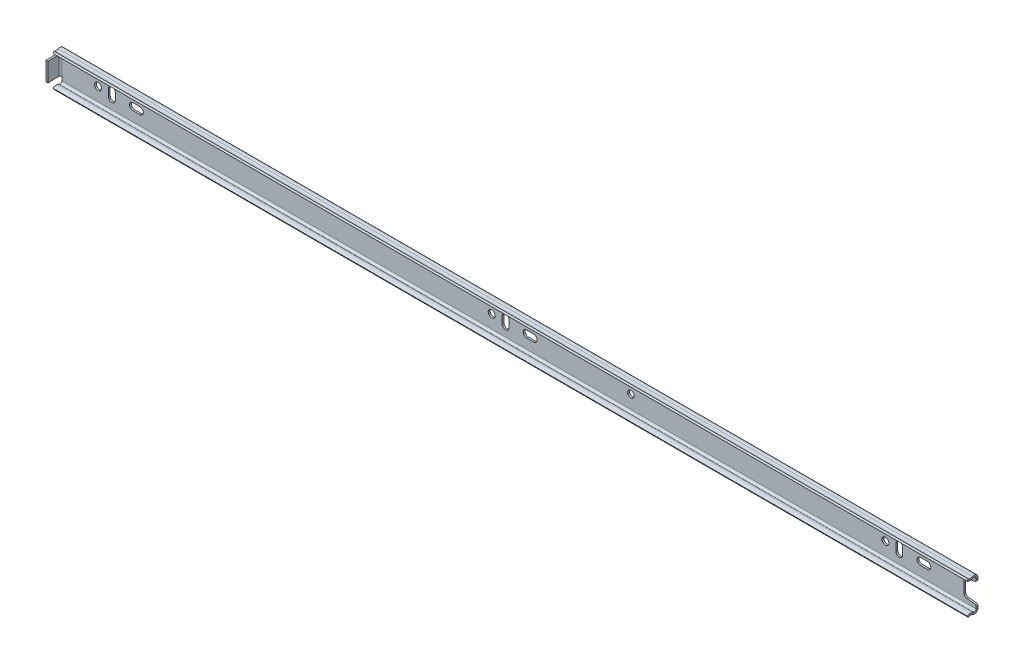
ISO-10303-21;
HEADER;
FILE_DESCRIPTION(('STEP AP214'),'2;1');
FILE_NAME('part.step','',(''),(''),'','','');
FILE_SCHEMA(('AUTOMOTIVE_DESIGN { 1 0 10303 214 1 1 1 1 }'));
ENDSEC;
DATA;
#1=APPLICATION_CONTEXT('core data for automotive mechanical design processes');
#2=APPLICATION_PROTOCOL_DEFINITION('international standard','automotive_design',2000,#1);
#3=PRODUCT_CONTEXT('',#1,'mechanical');
#4=PRODUCT('Part','Part','',(#3));
#5=PRODUCT_RELATED_PRODUCT_CATEGORY('part','',(#4));
#6=PRODUCT_DEFINITION_FORMATION('','',#4);
#7=PRODUCT_DEFINITION_CONTEXT('part definition',#1,'design');
#8=PRODUCT_DEFINITION('design','',#6,#7);
#9=PRODUCT_DEFINITION_SHAPE('','',#8);
#10=(LENGTH_UNIT() NAMED_UNIT(*) SI_UNIT(.MILLI.,.METRE.));
#11=(NAMED_UNIT(*) PLANE_ANGLE_UNIT() SI_UNIT($,.RADIAN.));
#12=(NAMED_UNIT(*) SI_UNIT($,.STERADIAN.) SOLID_ANGLE_UNIT());
#13=UNCERTAINTY_MEASURE_WITH_UNIT(LENGTH_MEASURE(1.E-05),#10,'distance_accuracy_value','');
#14=(GEOMETRIC_REPRESENTATION_CONTEXT(3) GLOBAL_UNCERTAINTY_ASSIGNED_CONTEXT((#13)) GLOBAL_UNIT_ASSIGNED_CONTEXT((#10,
#11,#12)) REPRESENTATION_CONTEXT('',''));
#15=CARTESIAN_POINT('',(0.,0.,0.));
#16=DIRECTION('',(0.,0.,1.));
#17=DIRECTION('',(1.,0.,0.));
#18=AXIS2_PLACEMENT_3D('',#15,#16,#17);
#19=CARTESIAN_POINT('',(239.5,0.,8.29421285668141));
#20=DIRECTION('',(0.,0.,-1.));
#21=DIRECTION('',(-1.,0.,0.));
#22=AXIS2_PLACEMENT_3D('',#19,#20,#21);
#23=CYLINDRICAL_SURFACE('',#22,2.24999999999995);
#24=CARTESIAN_POINT('',(239.5,0.,-1.2));
#25=DIRECTION('',(0.,0.,-1.));
#26=DIRECTION('',(-1.,0.,0.));
#27=AXIS2_PLACEMENT_3D('',#24,#25,#26);
#28=CIRCLE('',#27,2.24999999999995);
#29=CARTESIAN_POINT('',(237.25,0.,-1.2));
#30=VERTEX_POINT('',#29);
#31=EDGE_CURVE('E70',#30,#30,#28,.T.);
#32=ORIENTED_EDGE('',*,*,#31,.T.);
#33=EDGE_LOOP('',(#32));
#34=FACE_BOUND('',#33,.T.);
#35=CARTESIAN_POINT('',(239.5,0.,0.));
#36=DIRECTION('',(0.,0.,-1.));
#37=DIRECTION('',(-1.,0.,0.));
#38=AXIS2_PLACEMENT_3D('',#35,#36,#37);
#39=CIRCLE('',#38,2.24999999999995);
#40=CARTESIAN_POINT('',(237.25,0.,0.));
#41=VERTEX_POINT('',#40);
#42=EDGE_CURVE('E14',#41,#41,#39,.T.);
#43=ORIENTED_EDGE('',*,*,#42,.F.);
#44=EDGE_LOOP('',(#43));
#45=FACE_BOUND('',#44,.T.);
#46=ADVANCED_FACE('F63',(#34,#45),#23,.F.);
#47=CARTESIAN_POINT('',(250.75,-2.25000000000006,8.29421285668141));
#48=DIRECTION('',(1.,0.,0.));
#49=DIRECTION('',(0.,0.,-1.));
#50=AXIS2_PLACEMENT_3D('',#47,#48,#49);
#51=PLANE('',#50);
#52=DIRECTION('',(0.,0.,-1.));
#53=VECTOR('',#52,1.);
#54=CARTESIAN_POINT('',(250.75,2.24999999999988,8.29421285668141));
#55=LINE('',#54,#53);
#56=CARTESIAN_POINT('',(250.75,2.24999999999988,0.));
#57=VERTEX_POINT('',#56);
#58=CARTESIAN_POINT('',(250.75,2.24999999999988,-1.2));
#59=VERTEX_POINT('',#58);
#60=EDGE_CURVE('E860',#57,#59,#55,.T.);
#61=ORIENTED_EDGE('',*,*,#60,.T.);
#62=DIRECTION('',(0.,-1.,0.));
#63=VECTOR('',#62,1.);
#64=CARTESIAN_POINT('',(250.75,-2.25000000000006,-1.2));
#65=LINE('',#64,#63);
#66=CARTESIAN_POINT('',(250.75,-2.25000000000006,-1.2));
#67=VERTEX_POINT('',#66);
#68=EDGE_CURVE('E849',#59,#67,#65,.T.);
#69=ORIENTED_EDGE('',*,*,#68,.T.);
#70=DIRECTION('',(0.,0.,-1.));
#71=VECTOR('',#70,1.);
#72=CARTESIAN_POINT('',(250.75,-2.25000000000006,8.29421285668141));
#73=LINE('',#72,#71);
#74=CARTESIAN_POINT('',(250.75,-2.25000000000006,0.));
#75=VERTEX_POINT('',#74);
#76=EDGE_CURVE('E866',#75,#67,#73,.T.);
#77=ORIENTED_EDGE('',*,*,#76,.F.);
#78=DIRECTION('',(0.,-1.,0.));
#79=VECTOR('',#78,1.);
#80=CARTESIAN_POINT('',(250.75,7.37697646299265,0.));
#81=LINE('',#80,#79);
#82=EDGE_CURVE('E853',#57,#75,#81,.T.);
#83=ORIENTED_EDGE('',*,*,#82,.F.);
#84=EDGE_LOOP('',(#61,#69,#77,#83));
#85=FACE_BOUND('',#84,.T.);
#86=ADVANCED_FACE('F891',(#85),#51,.F.);
#87=CARTESIAN_POINT('',(248.5,-2.25000000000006,8.29421285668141));
#88=DIRECTION('',(0.,0.,-1.));
#89=DIRECTION('',(-1.,0.,0.));
#90=AXIS2_PLACEMENT_3D('',#87,#88,#89);
#91=CYLINDRICAL_SURFACE('',#90,2.24999999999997);
#92=ORIENTED_EDGE('',*,*,#76,.T.);
#93=CARTESIAN_POINT('',(248.5,-2.25000000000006,-1.2));
#94=DIRECTION('',(0.,0.,-1.));
#95=DIRECTION('',(-1.,0.,0.));
#96=AXIS2_PLACEMENT_3D('',#93,#94,#95);
#97=CIRCLE('',#96,2.24999999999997);
#98=CARTESIAN_POINT('',(246.25,-2.25000000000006,-1.2));
#99=VERTEX_POINT('',#98);
#100=EDGE_CURVE('E846',#67,#99,#97,.T.);
#101=ORIENTED_EDGE('',*,*,#100,.T.);
#102=DIRECTION('',(0.,0.,-1.));
#103=VECTOR('',#102,1.);
#104=CARTESIAN_POINT('',(246.25,-2.25000000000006,8.29421285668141));
#105=LINE('',#104,#103);
#106=CARTESIAN_POINT('',(246.25,-2.25000000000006,0.));
#107=VERTEX_POINT('',#106);
#108=EDGE_CURVE('E863',#107,#99,#105,.T.);
#109=ORIENTED_EDGE('',*,*,#108,.F.);
#110=CARTESIAN_POINT('',(248.5,-2.25000000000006,0.));
#111=DIRECTION('',(0.,0.,-1.));
#112=DIRECTION('',(-1.,0.,0.));
#113=AXIS2_PLACEMENT_3D('',#110,#111,#112);
#114=CIRCLE('',#113,2.24999999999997);
#115=EDGE_CURVE('E84',#75,#107,#114,.T.);
#116=ORIENTED_EDGE('',*,*,#115,.F.);
#117=EDGE_LOOP('',(#92,#101,#109,#116));
#118=FACE_BOUND('',#117,.T.);
#119=ADVANCED_FACE('F895',(#118),#91,.F.);
#120=CARTESIAN_POINT('',(246.25,-2.25000000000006,8.29421285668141));
#121=DIRECTION('',(-1.,0.,0.));
#122=DIRECTION('',(0.,0.,1.));
#123=AXIS2_PLACEMENT_3D('',#120,#121,#122);
#124=PLANE('',#123);
#125=ORIENTED_EDGE('',*,*,#108,.T.);
#126=DIRECTION('',(0.,1.,0.));
#127=VECTOR('',#126,1.);
#128=CARTESIAN_POINT('',(246.25,-2.25000000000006,-1.2));
#129=LINE('',#128,#127);
#130=CARTESIAN_POINT('',(246.25,2.24999999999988,-1.2));
#131=VERTEX_POINT('',#130);
#132=EDGE_CURVE('E843',#99,#131,#129,.T.);
#133=ORIENTED_EDGE('',*,*,#132,.T.);
#134=DIRECTION('',(0.,0.,-1.));
#135=VECTOR('',#134,1.);
#136=CARTESIAN_POINT('',(246.25,2.24999999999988,8.29421285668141));
#137=LINE('',#136,#135);
#138=CARTESIAN_POINT('',(246.25,2.24999999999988,0.));
#139=VERTEX_POINT('',#138);
#140=EDGE_CURVE('E858',#139,#131,#137,.T.);
#141=ORIENTED_EDGE('',*,*,#140,.F.);
#142=DIRECTION('',(0.,1.,0.));
#143=VECTOR('',#142,1.);
#144=CARTESIAN_POINT('',(246.25,7.37697646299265,0.));
#145=LINE('',#144,#143);
#146=EDGE_CURVE('E856',#107,#139,#145,.T.);
#147=ORIENTED_EDGE('',*,*,#146,.F.);
#148=EDGE_LOOP('',(#125,#133,#141,#147));
#149=FACE_BOUND('',#148,.T.);
#150=ADVANCED_FACE('F900',(#149),#124,.F.);
#151=CARTESIAN_POINT('',(248.5,2.24999999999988,8.29421285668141));
#152=DIRECTION('',(0.,0.,-1.));
#153=DIRECTION('',(-1.,0.,0.));
#154=AXIS2_PLACEMENT_3D('',#151,#152,#153);
#155=CYLINDRICAL_SURFACE('',#154,2.24999999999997);
#156=ORIENTED_EDGE('',*,*,#140,.T.);
#157=CARTESIAN_POINT('',(248.5,2.24999999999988,-1.2));
#158=DIRECTION('',(0.,0.,-1.));
#159=DIRECTION('',(-1.,0.,0.));
#160=AXIS2_PLACEMENT_3D('',#157,#158,#159);
#161=CIRCLE('',#160,2.24999999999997);
#162=EDGE_CURVE('E841',#131,#59,#161,.T.);
#163=ORIENTED_EDGE('',*,*,#162,.T.);
#164=ORIENTED_EDGE('',*,*,#60,.F.);
#165=CARTESIAN_POINT('',(248.5,2.24999999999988,0.));
#166=DIRECTION('',(0.,0.,-1.));
#167=DIRECTION('',(-1.,0.,0.));
#168=AXIS2_PLACEMENT_3D('',#165,#166,#167);
#169=CIRCLE('',#168,2.24999999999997);
#170=EDGE_CURVE('E77',#139,#57,#169,.T.);
#171=ORIENTED_EDGE('',*,*,#170,.F.);
#172=EDGE_LOOP('',(#156,#163,#164,#171));
#173=FACE_BOUND('',#172,.T.);
#174=ADVANCED_FACE('F906',(#173),#155,.F.);
#175=CARTESIAN_POINT('',(262.25,-2.25000000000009,8.29421285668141));
#176=DIRECTION('',(0.,-1.,0.));
#177=DIRECTION('',(1.,0.,0.));
#178=AXIS2_PLACEMENT_3D('',#175,#176,#177);
#179=PLANE('',#178);
#180=DIRECTION('',(0.,0.,-1.));
#181=VECTOR('',#180,1.);
#182=CARTESIAN_POINT('',(266.75,-2.25000000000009,8.29421285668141));
#183=LINE('',#182,#181);
#184=CARTESIAN_POINT('',(266.75,-2.25000000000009,0.));
#185=VERTEX_POINT('',#184);
#186=CARTESIAN_POINT('',(266.75,-2.25000000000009,-1.2));
#187=VERTEX_POINT('',#186);
#188=EDGE_CURVE('E832',#185,#187,#183,.T.);
#189=ORIENTED_EDGE('',*,*,#188,.T.);
#190=DIRECTION('',(-1.,0.,0.));
#191=VECTOR('',#190,1.);
#192=CARTESIAN_POINT('',(262.25,-2.25000000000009,-1.2));
#193=LINE('',#192,#191);
#194=CARTESIAN_POINT('',(262.25,-2.25000000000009,-1.2));
#195=VERTEX_POINT('',#194);
#196=EDGE_CURVE('E817',#187,#195,#193,.T.);
#197=ORIENTED_EDGE('',*,*,#196,.T.);
#198=DIRECTION('',(0.,0.,-1.));
#199=VECTOR('',#198,1.);
#200=CARTESIAN_POINT('',(262.25,-2.25000000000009,8.29421285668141));
#201=LINE('',#200,#199);
#202=CARTESIAN_POINT('',(262.25,-2.25000000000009,0.));
#203=VERTEX_POINT('',#202);
#204=EDGE_CURVE('E838',#203,#195,#201,.T.);
#205=ORIENTED_EDGE('',*,*,#204,.F.);
#206=DIRECTION('',(-1.,0.,0.));
#207=VECTOR('',#206,1.);
#208=CARTESIAN_POINT('',(809.5,-2.25000000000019,0.));
#209=LINE('',#208,#207);
#210=EDGE_CURVE('E822',#185,#203,#209,.T.);
#211=ORIENTED_EDGE('',*,*,#210,.F.);
#212=EDGE_LOOP('',(#189,#197,#205,#211));
#213=FACE_BOUND('',#212,.T.);
#214=ADVANCED_FACE('F910',(#213),#179,.F.);
#215=CARTESIAN_POINT('',(262.25,0.,8.29421285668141));
#216=DIRECTION('',(0.,0.,-1.));
#217=DIRECTION('',(-1.,0.,0.));
#218=AXIS2_PLACEMENT_3D('',#215,#216,#217);
#219=CYLINDRICAL_SURFACE('',#218,2.25);
#220=ORIENTED_EDGE('',*,*,#204,.T.);
#221=CARTESIAN_POINT('',(262.25,0.,-1.2));
#222=DIRECTION('',(0.,0.,-1.));
#223=DIRECTION('',(-1.,0.,0.));
#224=AXIS2_PLACEMENT_3D('',#221,#222,#223);
#225=CIRCLE('',#224,2.25);
#226=CARTESIAN_POINT('',(262.25,2.24999999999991,-1.2));
#227=VERTEX_POINT('',#226);
#228=EDGE_CURVE('E814',#195,#227,#225,.T.);
#229=ORIENTED_EDGE('',*,*,#228,.T.);
#230=DIRECTION('',(0.,0.,-1.));
#231=VECTOR('',#230,1.);
#232=CARTESIAN_POINT('',(262.25,2.24999999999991,8.29421285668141));
#233=LINE('',#232,#231);
#234=CARTESIAN_POINT('',(262.25,2.24999999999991,0.));
#235=VERTEX_POINT('',#234);
#236=EDGE_CURVE('E835',#235,#227,#233,.T.);
#237=ORIENTED_EDGE('',*,*,#236,.F.);
#238=CARTESIAN_POINT('',(262.25,0.,0.));
#239=DIRECTION('',(0.,0.,-1.));
#240=DIRECTION('',(-1.,0.,0.));
#241=AXIS2_PLACEMENT_3D('',#238,#239,#240);
#242=CIRCLE('',#241,2.25);
#243=EDGE_CURVE('E824',#203,#235,#242,.T.);
#244=ORIENTED_EDGE('',*,*,#243,.F.);
#245=EDGE_LOOP('',(#220,#229,#237,#244));
#246=FACE_BOUND('',#245,.T.);
#247=ADVANCED_FACE('F913',(#246),#219,.F.);
#248=CARTESIAN_POINT('',(262.25,2.24999999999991,8.29421285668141));
#249=DIRECTION('',(0.,1.,0.));
#250=DIRECTION('',(-1.,0.,0.));
#251=AXIS2_PLACEMENT_3D('',#248,#249,#250);
#252=PLANE('',#251);
#253=ORIENTED_EDGE('',*,*,#236,.T.);
#254=DIRECTION('',(1.,0.,0.));
#255=VECTOR('',#254,1.);
#256=CARTESIAN_POINT('',(262.25,2.24999999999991,-1.2));
#257=LINE('',#256,#255);
#258=CARTESIAN_POINT('',(266.75,2.24999999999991,-1.2));
#259=VERTEX_POINT('',#258);
#260=EDGE_CURVE('E811',#227,#259,#257,.T.);
#261=ORIENTED_EDGE('',*,*,#260,.T.);
#262=DIRECTION('',(0.,0.,-1.));
#263=VECTOR('',#262,1.);
#264=CARTESIAN_POINT('',(266.75,2.24999999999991,8.29421285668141));
#265=LINE('',#264,#263);
#266=CARTESIAN_POINT('',(266.75,2.24999999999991,0.));
#267=VERTEX_POINT('',#266);
#268=EDGE_CURVE('E829',#267,#259,#265,.T.);
#269=ORIENTED_EDGE('',*,*,#268,.F.);
#270=DIRECTION('',(1.,0.,0.));
#271=VECTOR('',#270,1.);
#272=CARTESIAN_POINT('',(809.5,2.24999999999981,0.));
#273=LINE('',#272,#271);
#274=EDGE_CURVE('E826',#235,#267,#273,.T.);
#275=ORIENTED_EDGE('',*,*,#274,.F.);
#276=EDGE_LOOP('',(#253,#261,#269,#275));
#277=FACE_BOUND('',#276,.T.);
#278=ADVANCED_FACE('F917',(#277),#252,.F.);
#279=CARTESIAN_POINT('',(266.75,0.,8.29421285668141));
#280=DIRECTION('',(0.,0.,-1.));
#281=DIRECTION('',(-1.,0.,0.));
#282=AXIS2_PLACEMENT_3D('',#279,#280,#281);
#283=CYLINDRICAL_SURFACE('',#282,2.25);
#284=ORIENTED_EDGE('',*,*,#268,.T.);
#285=CARTESIAN_POINT('',(266.75,0.,-1.2));
#286=DIRECTION('',(0.,0.,-1.));
#287=DIRECTION('',(-1.,0.,0.));
#288=AXIS2_PLACEMENT_3D('',#285,#286,#287);
#289=CIRCLE('',#288,2.25);
#290=EDGE_CURVE('E807',#259,#187,#289,.T.);
#291=ORIENTED_EDGE('',*,*,#290,.T.);
#292=ORIENTED_EDGE('',*,*,#188,.F.);
#293=CARTESIAN_POINT('',(266.75,0.,0.));
#294=DIRECTION('',(0.,0.,-1.));
#295=DIRECTION('',(-1.,0.,0.));
#296=AXIS2_PLACEMENT_3D('',#293,#294,#295);
#297=CIRCLE('',#296,2.25);
#298=EDGE_CURVE('E820',#267,#185,#297,.T.);
#299=ORIENTED_EDGE('',*,*,#298,.F.);
#300=EDGE_LOOP('',(#284,#291,#292,#299));
#301=FACE_BOUND('',#300,.T.);
#302=ADVANCED_FACE('F921',(#301),#283,.F.);
#303=CARTESIAN_POINT('',(-298.5,-6.09999999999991,0.));
#304=DIRECTION('',(0.,1.,0.));
#305=DIRECTION('',(0.,0.,1.));
#306=AXIS2_PLACEMENT_3D('',#303,#304,#305);
#307=PLANE('',#306);
#308=DIRECTION('',(0.,0.,1.));
#309=VECTOR('',#308,1.);
#310=CARTESIAN_POINT('',(-296.,-6.09999999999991,-1.2));
#311=LINE('',#310,#309);
#312=CARTESIAN_POINT('',(-296.,-6.09999999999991,-1.2));
#313=VERTEX_POINT('',#312);
#314=CARTESIAN_POINT('',(-296.,-6.09999999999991,-1.19571401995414));
#315=VERTEX_POINT('',#314);
#316=EDGE_CURVE('E766',#313,#315,#311,.T.);
#317=ORIENTED_EDGE('',*,*,#316,.T.);
#318=CARTESIAN_POINT('',(-295.856632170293,-6.09999999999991,1.20000000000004));
#319=DIRECTION('',(0.,-1.,0.));
#320=DIRECTION('',(0.,0.,-1.));
#321=AXIS2_PLACEMENT_3D('',#318,#319,#320);
#322=CIRCLE('',#321,2.39999999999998);
#323=CARTESIAN_POINT('',(-295.856632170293,-6.09999999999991,-1.2));
#324=VERTEX_POINT('',#323);
#325=EDGE_CURVE('E564',#315,#324,#322,.T.);
#326=ORIENTED_EDGE('',*,*,#325,.T.);
#327=DIRECTION('',(1.,0.,0.));
#328=VECTOR('',#327,1.);
#329=CARTESIAN_POINT('',(297.5,-6.09999999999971,-1.2));
#330=LINE('',#329,#328);
#331=EDGE_CURVE('E576',#313,#324,#330,.T.);
#332=ORIENTED_EDGE('',*,*,#331,.F.);
#333=EDGE_LOOP('',(#317,#326,#332));
#334=FACE_BOUND('',#333,.T.);
#335=ADVANCED_FACE('F885',(#334),#307,.T.);
#336=CARTESIAN_POINT('',(-295.856632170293,6.10000000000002,0.));
#337=DIRECTION('',(0.,-1.,0.));
#338=DIRECTION('',(0.,0.,-1.));
#339=AXIS2_PLACEMENT_3D('',#336,#337,#338);
#340=PLANE('',#339);
#341=DIRECTION('',(-1.,0.,0.));
#342=VECTOR('',#341,1.);
#343=CARTESIAN_POINT('',(297.5,6.10000000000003,-1.2));
#344=LINE('',#343,#342);
#345=CARTESIAN_POINT('',(-295.856632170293,6.10000000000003,-1.2));
#346=VERTEX_POINT('',#345);
#347=CARTESIAN_POINT('',(-296.,6.10000000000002,-1.2));
#348=VERTEX_POINT('',#347);
#349=EDGE_CURVE('E574',#346,#348,#344,.T.);
#350=ORIENTED_EDGE('',*,*,#349,.F.);
#351=CARTESIAN_POINT('',(-295.856632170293,6.10000000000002,1.20000000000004));
#352=DIRECTION('',(0.,-1.,0.));
#353=DIRECTION('',(0.,0.,-1.));
#354=AXIS2_PLACEMENT_3D('',#351,#352,#353);
#355=CIRCLE('',#354,2.39999999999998);
#356=CARTESIAN_POINT('',(-296.,6.10000000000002,-1.19571401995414));
#357=VERTEX_POINT('',#356);
#358=EDGE_CURVE('E558',#346,#357,#355,.F.);
#359=ORIENTED_EDGE('',*,*,#358,.T.);
#360=DIRECTION('',(0.,0.,1.));
#361=VECTOR('',#360,1.);
#362=CARTESIAN_POINT('',(-296.,6.10000000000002,-1.2));
#363=LINE('',#362,#361);
#364=EDGE_CURVE('E770',#348,#357,#363,.T.);
#365=ORIENTED_EDGE('',*,*,#364,.F.);
#366=EDGE_LOOP('',(#350,#359,#365));
#367=FACE_BOUND('',#366,.T.);
#368=ADVANCED_FACE('F875',(#367),#340,.T.);
#369=CARTESIAN_POINT('',(297.5,7.37697646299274,-1.2));
#370=DIRECTION('',(0.,0.,-1.));
#371=DIRECTION('',(-1.,0.,0.));
#372=AXIS2_PLACEMENT_3D('',#369,#370,#371);
#373=PLANE('',#372);
#374=CARTESIAN_POINT('',(-16.5,0.,-1.2));
#375=DIRECTION('',(0.,0.,-1.));
#376=DIRECTION('',(-1.,0.,0.));
#377=AXIS2_PLACEMENT_3D('',#374,#375,#376);
#378=CIRCLE('',#377,2.24999999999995);
#379=CARTESIAN_POINT('',(-18.7499999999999,0.,-1.2));
#380=VERTEX_POINT('',#379);
#381=EDGE_CURVE('E1647',#380,#380,#378,.T.);
#382=ORIENTED_EDGE('',*,*,#381,.F.);
#383=EDGE_LOOP('',(#382));
#384=FACE_BOUND('',#383,.T.);
#385=CARTESIAN_POINT('',(-7.49999999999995,2.24999999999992,-1.2));
#386=DIRECTION('',(0.,0.,-1.));
#387=DIRECTION('',(-1.,0.,0.));
#388=AXIS2_PLACEMENT_3D('',#385,#386,#387);
#389=CIRCLE('',#388,2.24999999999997);
#390=CARTESIAN_POINT('',(-9.74999999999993,2.24999999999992,-1.2));
#391=VERTEX_POINT('',#390);
#392=CARTESIAN_POINT('',(-5.24999999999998,2.24999999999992,-1.2));
#393=VERTEX_POINT('',#392);
#394=EDGE_CURVE('E436',#391,#393,#389,.T.);
#395=ORIENTED_EDGE('',*,*,#394,.F.);
#396=DIRECTION('',(0.,1.,0.));
#397=VECTOR('',#396,1.);
#398=CARTESIAN_POINT('',(-9.74999999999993,-2.25000000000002,-1.2));
#399=LINE('',#398,#397);
#400=CARTESIAN_POINT('',(-9.74999999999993,-2.25000000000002,-1.2));
#401=VERTEX_POINT('',#400);
#402=EDGE_CURVE('E422',#401,#391,#399,.T.);
#403=ORIENTED_EDGE('',*,*,#402,.F.);
#404=CARTESIAN_POINT('',(-7.49999999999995,-2.25000000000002,-1.2));
#405=DIRECTION('',(0.,0.,-1.));
#406=DIRECTION('',(-1.,0.,0.));
#407=AXIS2_PLACEMENT_3D('',#404,#405,#406);
#408=CIRCLE('',#407,2.24999999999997);
#409=CARTESIAN_POINT('',(-5.24999999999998,-2.25000000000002,-1.2));
#410=VERTEX_POINT('',#409);
#411=EDGE_CURVE('E414',#410,#401,#408,.T.);
#412=ORIENTED_EDGE('',*,*,#411,.F.);
#413=DIRECTION('',(0.,-1.,0.));
#414=VECTOR('',#413,1.);
#415=CARTESIAN_POINT('',(-5.24999999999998,-2.25000000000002,-1.2));
#416=LINE('',#415,#414);
#417=EDGE_CURVE('E399',#393,#410,#416,.T.);
#418=ORIENTED_EDGE('',*,*,#417,.F.);
#419=EDGE_LOOP('',(#395,#403,#412,#418));
#420=FACE_BOUND('',#419,.T.);
#421=CARTESIAN_POINT('',(10.7500000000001,0.,-1.2));
#422=DIRECTION('',(0.,0.,-1.));
#423=DIRECTION('',(-1.,0.,0.));
#424=AXIS2_PLACEMENT_3D('',#421,#422,#423);
#425=CIRCLE('',#424,2.25);
#426=CARTESIAN_POINT('',(10.7500000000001,2.24999999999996,-1.2));
#427=VERTEX_POINT('',#426);
#428=CARTESIAN_POINT('',(10.7500000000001,-2.25000000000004,-1.2));
#429=VERTEX_POINT('',#428);
#430=EDGE_CURVE('E468',#427,#429,#425,.T.);
#431=ORIENTED_EDGE('',*,*,#430,.F.);
#432=DIRECTION('',(1.,0.,0.));
#433=VECTOR('',#432,1.);
#434=CARTESIAN_POINT('',(6.25000000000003,2.24999999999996,-1.2));
#435=LINE('',#434,#433);
#436=CARTESIAN_POINT('',(6.25000000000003,2.24999999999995,-1.2));
#437=VERTEX_POINT('',#436);
#438=EDGE_CURVE('E460',#437,#427,#435,.T.);
#439=ORIENTED_EDGE('',*,*,#438,.F.);
#440=CARTESIAN_POINT('',(6.25000000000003,0.,-1.2));
#441=DIRECTION('',(0.,0.,-1.));
#442=DIRECTION('',(-1.,0.,0.));
#443=AXIS2_PLACEMENT_3D('',#440,#441,#442);
#444=CIRCLE('',#443,2.25);
#445=CARTESIAN_POINT('',(6.25000000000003,-2.25000000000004,-1.2));
#446=VERTEX_POINT('',#445);
#447=EDGE_CURVE('E452',#446,#437,#444,.T.);
#448=ORIENTED_EDGE('',*,*,#447,.F.);
#449=DIRECTION('',(-1.,0.,0.));
#450=VECTOR('',#449,1.);
#451=CARTESIAN_POINT('',(6.25000000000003,-2.25000000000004,-1.2));
#452=LINE('',#451,#450);
#453=EDGE_CURVE('E441',#429,#446,#452,.T.);
#454=ORIENTED_EDGE('',*,*,#453,.F.);
#455=EDGE_LOOP('',(#431,#439,#448,#454));
#456=FACE_BOUND('',#455,.T.);
#457=CARTESIAN_POINT('',(74.,0.,-1.2));
#458=DIRECTION('',(0.,0.,-1.));
#459=DIRECTION('',(-1.,0.,0.));
#460=AXIS2_PLACEMENT_3D('',#457,#458,#459);
#461=CIRCLE('',#460,2.09999999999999);
#462=CARTESIAN_POINT('',(71.9,0.,-1.2));
#463=VERTEX_POINT('',#462);
#464=EDGE_CURVE('E473',#463,#463,#461,.T.);
#465=ORIENTED_EDGE('',*,*,#464,.F.);
#466=EDGE_LOOP('',(#465));
#467=FACE_BOUND('',#466,.T.);
#468=CARTESIAN_POINT('',(-245.25,0.,-1.2));
#469=DIRECTION('',(0.,0.,-1.));
#470=DIRECTION('',(-1.,0.,0.));
#471=AXIS2_PLACEMENT_3D('',#468,#469,#470);
#472=CIRCLE('',#471,2.25);
#473=CARTESIAN_POINT('',(-245.25,2.25000000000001,-1.2));
#474=VERTEX_POINT('',#473);
#475=CARTESIAN_POINT('',(-245.25,-2.25,-1.2));
#476=VERTEX_POINT('',#475);
#477=EDGE_CURVE('E482',#474,#476,#472,.T.);
#478=ORIENTED_EDGE('',*,*,#477,.F.);
#479=DIRECTION('',(1.,0.,0.));
#480=VECTOR('',#479,1.);
#481=CARTESIAN_POINT('',(-249.75,2.25000000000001,-1.2));
#482=LINE('',#481,#480);
#483=CARTESIAN_POINT('',(-249.75,2.25,-1.2));
#484=VERTEX_POINT('',#483);
#485=EDGE_CURVE('E490',#484,#474,#482,.T.);
#486=ORIENTED_EDGE('',*,*,#485,.F.);
#487=CARTESIAN_POINT('',(-249.75,0.,-1.2));
#488=DIRECTION('',(0.,0.,-1.));
#489=DIRECTION('',(-1.,0.,0.));
#490=AXIS2_PLACEMENT_3D('',#487,#488,#489);
#491=CIRCLE('',#490,2.25);
#492=CARTESIAN_POINT('',(-249.75,-2.25,-1.2));
#493=VERTEX_POINT('',#492);
#494=EDGE_CURVE('E487',#493,#484,#491,.T.);
#495=ORIENTED_EDGE('',*,*,#494,.F.);
#496=DIRECTION('',(-1.,0.,0.));
#497=VECTOR('',#496,1.);
#498=CARTESIAN_POINT('',(-249.75,-2.25,-1.2));
#499=LINE('',#498,#497);
#500=EDGE_CURVE('E484',#476,#493,#499,.T.);
#501=ORIENTED_EDGE('',*,*,#500,.F.);
#502=EDGE_LOOP('',(#478,#486,#495,#501));
#503=FACE_BOUND('',#502,.T.);
#504=CARTESIAN_POINT('',(-272.5,0.,-1.2));
#505=DIRECTION('',(0.,0.,-1.));
#506=DIRECTION('',(-1.,0.,0.));
#507=AXIS2_PLACEMENT_3D('',#504,#505,#506);
#508=CIRCLE('',#507,2.24999999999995);
#509=CARTESIAN_POINT('',(-274.75,0.,-1.2));
#510=VERTEX_POINT('',#509);
#511=EDGE_CURVE('E477',#510,#510,#508,.T.);
#512=ORIENTED_EDGE('',*,*,#511,.F.);
#513=EDGE_LOOP('',(#512));
#514=FACE_BOUND('',#513,.T.);
#515=CARTESIAN_POINT('',(-263.5,2.24999999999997,-1.2));
#516=DIRECTION('',(0.,0.,-1.));
#517=DIRECTION('',(-1.,0.,0.));
#518=AXIS2_PLACEMENT_3D('',#515,#516,#517);
#519=CIRCLE('',#518,2.24999999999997);
#520=CARTESIAN_POINT('',(-265.75,2.24999999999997,-1.2));
#521=VERTEX_POINT('',#520);
#522=CARTESIAN_POINT('',(-261.25,2.24999999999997,-1.2));
#523=VERTEX_POINT('',#522);
#524=EDGE_CURVE('E480',#521,#523,#519,.T.);
#525=ORIENTED_EDGE('',*,*,#524,.F.);
#526=DIRECTION('',(0.,1.,0.));
#527=VECTOR('',#526,1.);
#528=CARTESIAN_POINT('',(-265.75,-2.24999999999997,-1.2));
#529=LINE('',#528,#527);
#530=CARTESIAN_POINT('',(-265.75,-2.24999999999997,-1.2));
#531=VERTEX_POINT('',#530);
#532=EDGE_CURVE('E508',#531,#521,#529,.T.);
#533=ORIENTED_EDGE('',*,*,#532,.F.);
#534=CARTESIAN_POINT('',(-263.5,-2.24999999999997,-1.2));
#535=DIRECTION('',(0.,0.,-1.));
#536=DIRECTION('',(-1.,0.,0.));
#537=AXIS2_PLACEMENT_3D('',#534,#535,#536);
#538=CIRCLE('',#537,2.24999999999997);
#539=CARTESIAN_POINT('',(-261.25,-2.24999999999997,-1.2));
#540=VERTEX_POINT('',#539);
#541=EDGE_CURVE('E505',#540,#531,#538,.T.);
#542=ORIENTED_EDGE('',*,*,#541,.F.);
#543=DIRECTION('',(0.,-1.,0.));
#544=VECTOR('',#543,1.);
#545=CARTESIAN_POINT('',(-261.25,-2.24999999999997,-1.2));
#546=LINE('',#545,#544);
#547=EDGE_CURVE('E502',#523,#540,#546,.T.);
#548=ORIENTED_EDGE('',*,*,#547,.F.);
#549=EDGE_LOOP('',(#525,#533,#542,#548));
#550=FACE_BOUND('',#549,.T.);
#551=DIRECTION('',(0.,-1.,0.));
#552=VECTOR('',#551,1.);
#553=CARTESIAN_POINT('',(-296.,-8.59999999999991,-1.2));
#554=LINE('',#553,#552);
#555=CARTESIAN_POINT('',(-296.,-8.59999999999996,-1.2));
#556=VERTEX_POINT('',#555);
#557=EDGE_CURVE('E677',#313,#556,#554,.T.);
#558=ORIENTED_EDGE('',*,*,#557,.F.);
#559=ORIENTED_EDGE('',*,*,#331,.T.);
#560=DIRECTION('',(0.,-1.,0.));
#561=VECTOR('',#560,1.);
#562=CARTESIAN_POINT('',(-295.856632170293,-6.09999999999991,-1.19999999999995));
#563=LINE('',#562,#561);
#564=EDGE_CURVE('E554',#324,#346,#563,.F.);
#565=ORIENTED_EDGE('',*,*,#564,.T.);
#566=ORIENTED_EDGE('',*,*,#349,.T.);
#567=DIRECTION('',(0.,-1.,0.));
#568=VECTOR('',#567,1.);
#569=CARTESIAN_POINT('',(-296.,8.60000000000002,-1.2));
#570=LINE('',#569,#568);
#571=CARTESIAN_POINT('',(-296.,8.59999999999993,-1.2));
#572=VERTEX_POINT('',#571);
#573=EDGE_CURVE('E674',#572,#348,#570,.T.);
#574=ORIENTED_EDGE('',*,*,#573,.F.);
#575=DIRECTION('',(-1.,0.,0.));
#576=VECTOR('',#575,1.);
#577=CARTESIAN_POINT('',(-296.,8.60000000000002,-1.2));
#578=LINE('',#577,#576);
#579=CARTESIAN_POINT('',(298.5,8.59999999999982,-1.2));
#580=VERTEX_POINT('',#579);
#581=EDGE_CURVE('E671',#580,#572,#578,.T.);
#582=ORIENTED_EDGE('',*,*,#581,.F.);
#583=DIRECTION('',(0.,1.,0.));
#584=VECTOR('',#583,1.);
#585=CARTESIAN_POINT('',(298.5,8.59999999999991,-1.2));
#586=LINE('',#585,#584);
#587=CARTESIAN_POINT('',(298.5,7.37697646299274,-1.2));
#588=VERTEX_POINT('',#587);
#589=EDGE_CURVE('E668',#588,#580,#586,.T.);
#590=ORIENTED_EDGE('',*,*,#589,.F.);
#591=CARTESIAN_POINT('',(297.5,7.37697646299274,-1.2));
#592=DIRECTION('',(0.,0.,1.));
#593=DIRECTION('',(-1.,0.,0.));
#594=AXIS2_PLACEMENT_3D('',#591,#592,#593);
#595=CIRCLE('',#594,0.999999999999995);
#596=CARTESIAN_POINT('',(297.63052619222,6.38553160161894,-1.2));
#597=VERTEX_POINT('',#596);
#598=EDGE_CURVE('E703',#597,#588,#595,.T.);
#599=ORIENTED_EDGE('',*,*,#598,.F.);
#600=DIRECTION('',(0.991444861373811,0.13052619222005,0.));
#601=VECTOR('',#600,1.);
#602=CARTESIAN_POINT('',(292.23894761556,5.67571681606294,-1.2));
#603=LINE('',#602,#601);
#604=CARTESIAN_POINT('',(292.23894761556,5.67571681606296,-1.2));
#605=VERTEX_POINT('',#604);
#606=EDGE_CURVE('E700',#605,#597,#603,.T.);
#607=ORIENTED_EDGE('',*,*,#606,.F.);
#608=CARTESIAN_POINT('',(292.5,3.69282709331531,-1.2));
#609=DIRECTION('',(0.,0.,-1.));
#610=DIRECTION('',(1.,0.,0.));
#611=AXIS2_PLACEMENT_3D('',#608,#609,#610);
#612=CIRCLE('',#611,2.00000000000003);
#613=CARTESIAN_POINT('',(290.5,3.69282709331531,-1.2));
#614=VERTEX_POINT('',#613);
#615=EDGE_CURVE('E697',#614,#605,#612,.T.);
#616=ORIENTED_EDGE('',*,*,#615,.F.);
#617=DIRECTION('',(0.,1.,0.));
#618=VECTOR('',#617,1.);
#619=CARTESIAN_POINT('',(290.5,3.69282709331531,-1.2));
#620=LINE('',#619,#618);
#621=CARTESIAN_POINT('',(290.5,-3.69282709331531,-1.2));
#622=VERTEX_POINT('',#621);
#623=EDGE_CURVE('E694',#622,#614,#620,.T.);
#624=ORIENTED_EDGE('',*,*,#623,.F.);
#625=CARTESIAN_POINT('',(292.5,-3.69282709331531,-1.2));
#626=DIRECTION('',(0.,0.,-1.));
#627=DIRECTION('',(-1.,0.,0.));
#628=AXIS2_PLACEMENT_3D('',#625,#626,#627);
#629=CIRCLE('',#628,2.00000000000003);
#630=CARTESIAN_POINT('',(292.23894761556,-5.67571681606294,-1.2));
#631=VERTEX_POINT('',#630);
#632=EDGE_CURVE('E691',#631,#622,#629,.T.);
#633=ORIENTED_EDGE('',*,*,#632,.F.);
#634=DIRECTION('',(-0.99144486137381,0.130526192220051,0.));
#635=VECTOR('',#634,1.);
#636=CARTESIAN_POINT('',(292.23894761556,-5.67571681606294,-1.2));
#637=LINE('',#636,#635);
#638=CARTESIAN_POINT('',(297.63052619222,-6.38553160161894,-1.2));
#639=VERTEX_POINT('',#638);
#640=EDGE_CURVE('E688',#639,#631,#637,.T.);
#641=ORIENTED_EDGE('',*,*,#640,.F.);
#642=CARTESIAN_POINT('',(297.5,-7.37697646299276,-1.2));
#643=DIRECTION('',(0.,0.,1.));
#644=DIRECTION('',(1.,0.,0.));
#645=AXIS2_PLACEMENT_3D('',#642,#643,#644);
#646=CIRCLE('',#645,0.999999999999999);
#647=CARTESIAN_POINT('',(298.5,-7.37697646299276,-1.2));
#648=VERTEX_POINT('',#647);
#649=EDGE_CURVE('E685',#648,#639,#646,.T.);
#650=ORIENTED_EDGE('',*,*,#649,.F.);
#651=DIRECTION('',(0.,1.,0.));
#652=VECTOR('',#651,1.);
#653=CARTESIAN_POINT('',(298.5,-7.37697646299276,-1.2));
#654=LINE('',#653,#652);
#655=CARTESIAN_POINT('',(298.5,-8.59999999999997,-1.2));
#656=VERTEX_POINT('',#655);
#657=EDGE_CURVE('E682',#656,#648,#654,.T.);
#658=ORIENTED_EDGE('',*,*,#657,.F.);
#659=DIRECTION('',(1.,0.,0.));
#660=VECTOR('',#659,1.);
#661=CARTESIAN_POINT('',(298.5,-8.59999999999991,-1.2));
#662=LINE('',#661,#660);
#663=EDGE_CURVE('E680',#556,#656,#662,.T.);
#664=ORIENTED_EDGE('',*,*,#663,.F.);
#665=EDGE_LOOP('',(#558,#559,#565,#566,#574,#582,#590,#599,#607,#616,#624,#633,#641,#650,#658,#664));
#666=FACE_BOUND('',#665,.T.);
#667=ORIENTED_EDGE('',*,*,#290,.F.);
#668=ORIENTED_EDGE('',*,*,#260,.F.);
#669=ORIENTED_EDGE('',*,*,#228,.F.);
#670=ORIENTED_EDGE('',*,*,#196,.F.);
#671=EDGE_LOOP('',(#667,#668,#669,#670));
#672=FACE_BOUND('',#671,.T.);
#673=ORIENTED_EDGE('',*,*,#162,.F.);
#674=ORIENTED_EDGE('',*,*,#132,.F.);
#675=ORIENTED_EDGE('',*,*,#100,.F.);
#676=ORIENTED_EDGE('',*,*,#68,.F.);
#677=EDGE_LOOP('',(#673,#674,#675,#676));
#678=FACE_BOUND('',#677,.T.);
#679=ORIENTED_EDGE('',*,*,#31,.F.);
#680=EDGE_LOOP('',(#679));
#681=FACE_BOUND('',#680,.T.);
#682=ADVANCED_FACE('F420',(#384,#420,#456,#467,#503,#514,#550,#666,#672,#678,#681),#373,.T.);
#683=CARTESIAN_POINT('',(297.5,7.37697646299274,0.));
#684=DIRECTION('',(0.,0.,-1.));
#685=DIRECTION('',(-1.,0.,0.));
#686=AXIS2_PLACEMENT_3D('',#683,#684,#685);
#687=PLANE('',#686);
#688=CARTESIAN_POINT('',(-16.5,0.,0.));
#689=DIRECTION('',(0.,0.,-1.));
#690=DIRECTION('',(-1.,0.,0.));
#691=AXIS2_PLACEMENT_3D('',#688,#689,#690);
#692=CIRCLE('',#691,2.24999999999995);
#693=CARTESIAN_POINT('',(-18.7499999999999,0.,0.));
#694=VERTEX_POINT('',#693);
#695=EDGE_CURVE('E410',#694,#694,#692,.T.);
#696=ORIENTED_EDGE('',*,*,#695,.T.);
#697=EDGE_LOOP('',(#696));
#698=FACE_BOUND('',#697,.T.);
#699=DIRECTION('',(0.,1.,0.));
#700=VECTOR('',#699,1.);
#701=CARTESIAN_POINT('',(-9.74999999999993,7.37697646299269,0.));
#702=LINE('',#701,#700);
#703=CARTESIAN_POINT('',(-9.74999999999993,-2.25000000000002,0.));
#704=VERTEX_POINT('',#703);
#705=CARTESIAN_POINT('',(-9.74999999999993,2.24999999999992,0.));
#706=VERTEX_POINT('',#705);
#707=EDGE_CURVE('E433',#704,#706,#702,.T.);
#708=ORIENTED_EDGE('',*,*,#707,.T.);
#709=CARTESIAN_POINT('',(-7.49999999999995,2.24999999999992,0.));
#710=DIRECTION('',(0.,0.,-1.));
#711=DIRECTION('',(-1.,0.,0.));
#712=AXIS2_PLACEMENT_3D('',#709,#710,#711);
#713=CIRCLE('',#712,2.24999999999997);
#714=CARTESIAN_POINT('',(-5.24999999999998,2.24999999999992,0.));
#715=VERTEX_POINT('',#714);
#716=EDGE_CURVE('E438',#706,#715,#713,.T.);
#717=ORIENTED_EDGE('',*,*,#716,.T.);
#718=DIRECTION('',(0.,-1.,0.));
#719=VECTOR('',#718,1.);
#720=CARTESIAN_POINT('',(-5.24999999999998,7.37697646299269,0.));
#721=LINE('',#720,#719);
#722=CARTESIAN_POINT('',(-5.24999999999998,-2.25000000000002,0.));
#723=VERTEX_POINT('',#722);
#724=EDGE_CURVE('E409',#715,#723,#721,.T.);
#725=ORIENTED_EDGE('',*,*,#724,.T.);
#726=CARTESIAN_POINT('',(-7.49999999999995,-2.25000000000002,0.));
#727=DIRECTION('',(0.,0.,-1.));
#728=DIRECTION('',(-1.,0.,0.));
#729=AXIS2_PLACEMENT_3D('',#726,#727,#728);
#730=CIRCLE('',#729,2.24999999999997);
#731=EDGE_CURVE('E417',#723,#704,#730,.T.);
#732=ORIENTED_EDGE('',*,*,#731,.T.);
#733=EDGE_LOOP('',(#708,#717,#725,#732));
#734=FACE_BOUND('',#733,.T.);
#735=DIRECTION('',(1.,0.,0.));
#736=VECTOR('',#735,1.);
#737=CARTESIAN_POINT('',(553.5,2.24999999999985,0.));
#738=LINE('',#737,#736);
#739=CARTESIAN_POINT('',(6.25000000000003,2.24999999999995,0.));
#740=VERTEX_POINT('',#739);
#741=CARTESIAN_POINT('',(10.7500000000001,2.24999999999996,0.));
#742=VERTEX_POINT('',#741);
#743=EDGE_CURVE('E465',#740,#742,#738,.T.);
#744=ORIENTED_EDGE('',*,*,#743,.T.);
#745=CARTESIAN_POINT('',(10.7500000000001,0.,0.));
#746=DIRECTION('',(0.,0.,-1.));
#747=DIRECTION('',(-1.,0.,0.));
#748=AXIS2_PLACEMENT_3D('',#745,#746,#747);
#749=CIRCLE('',#748,2.25);
#750=CARTESIAN_POINT('',(10.7500000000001,-2.25000000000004,0.));
#751=VERTEX_POINT('',#750);
#752=EDGE_CURVE('E470',#742,#751,#749,.T.);
#753=ORIENTED_EDGE('',*,*,#752,.T.);
#754=DIRECTION('',(-1.,0.,0.));
#755=VECTOR('',#754,1.);
#756=CARTESIAN_POINT('',(553.5,-2.25000000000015,0.));
#757=LINE('',#756,#755);
#758=CARTESIAN_POINT('',(6.25000000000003,-2.25000000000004,0.));
#759=VERTEX_POINT('',#758);
#760=EDGE_CURVE('E443',#751,#759,#757,.T.);
#761=ORIENTED_EDGE('',*,*,#760,.T.);
#762=CARTESIAN_POINT('',(6.25000000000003,0.,0.));
#763=DIRECTION('',(0.,0.,-1.));
#764=DIRECTION('',(-1.,0.,0.));
#765=AXIS2_PLACEMENT_3D('',#762,#763,#764);
#766=CIRCLE('',#765,2.25);
#767=EDGE_CURVE('E457',#759,#740,#766,.T.);
#768=ORIENTED_EDGE('',*,*,#767,.T.);
#769=EDGE_LOOP('',(#744,#753,#761,#768));
#770=FACE_BOUND('',#769,.T.);
#771=CARTESIAN_POINT('',(74.,0.,0.));
#772=DIRECTION('',(0.,0.,-1.));
#773=DIRECTION('',(-1.,0.,0.));
#774=AXIS2_PLACEMENT_3D('',#771,#772,#773);
#775=CIRCLE('',#774,2.09999999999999);
#776=CARTESIAN_POINT('',(71.9,0.,0.));
#777=VERTEX_POINT('',#776);
#778=EDGE_CURVE('E476',#777,#777,#775,.T.);
#779=ORIENTED_EDGE('',*,*,#778,.T.);
#780=EDGE_LOOP('',(#779));
#781=FACE_BOUND('',#780,.T.);
#782=DIRECTION('',(1.,0.,0.));
#783=VECTOR('',#782,1.);
#784=CARTESIAN_POINT('',(297.5,2.2499999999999,0.));
#785=LINE('',#784,#783);
#786=CARTESIAN_POINT('',(-249.75,2.25,0.));
#787=VERTEX_POINT('',#786);
#788=CARTESIAN_POINT('',(-245.25,2.25000000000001,0.));
#789=VERTEX_POINT('',#788);
#790=EDGE_CURVE('E801',#787,#789,#785,.T.);
#791=ORIENTED_EDGE('',*,*,#790,.T.);
#792=CARTESIAN_POINT('',(-245.25,0.,0.));
#793=DIRECTION('',(0.,0.,-1.));
#794=DIRECTION('',(-1.,0.,0.));
#795=AXIS2_PLACEMENT_3D('',#792,#793,#794);
#796=CIRCLE('',#795,2.25);
#797=CARTESIAN_POINT('',(-245.25,-2.25,0.));
#798=VERTEX_POINT('',#797);
#799=EDGE_CURVE('E804',#789,#798,#796,.T.);
#800=ORIENTED_EDGE('',*,*,#799,.T.);
#801=DIRECTION('',(-1.,0.,0.));
#802=VECTOR('',#801,1.);
#803=CARTESIAN_POINT('',(297.5,-2.2500000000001,0.));
#804=LINE('',#803,#802);
#805=CARTESIAN_POINT('',(-249.75,-2.25,0.));
#806=VERTEX_POINT('',#805);
#807=EDGE_CURVE('E793',#798,#806,#804,.T.);
#808=ORIENTED_EDGE('',*,*,#807,.T.);
#809=CARTESIAN_POINT('',(-249.75,0.,0.));
#810=DIRECTION('',(0.,0.,-1.));
#811=DIRECTION('',(-1.,0.,0.));
#812=AXIS2_PLACEMENT_3D('',#809,#810,#811);
#813=CIRCLE('',#812,2.25);
#814=EDGE_CURVE('E798',#806,#787,#813,.T.);
#815=ORIENTED_EDGE('',*,*,#814,.T.);
#816=EDGE_LOOP('',(#791,#800,#808,#815));
#817=FACE_BOUND('',#816,.T.);
#818=CARTESIAN_POINT('',(-272.5,0.,0.));
#819=DIRECTION('',(0.,0.,-1.));
#820=DIRECTION('',(-1.,0.,0.));
#821=AXIS2_PLACEMENT_3D('',#818,#819,#820);
#822=CIRCLE('',#821,2.24999999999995);
#823=CARTESIAN_POINT('',(-274.75,0.,0.));
#824=VERTEX_POINT('',#823);
#825=EDGE_CURVE('E514',#824,#824,#822,.T.);
#826=ORIENTED_EDGE('',*,*,#825,.T.);
#827=EDGE_LOOP('',(#826));
#828=FACE_BOUND('',#827,.T.);
#829=DIRECTION('',(0.,1.,0.));
#830=VECTOR('',#829,1.);
#831=CARTESIAN_POINT('',(-265.75,7.37697646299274,0.));
#832=LINE('',#831,#830);
#833=CARTESIAN_POINT('',(-265.75,-2.24999999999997,0.));
#834=VERTEX_POINT('',#833);
#835=CARTESIAN_POINT('',(-265.75,2.24999999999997,0.));
#836=VERTEX_POINT('',#835);
#837=EDGE_CURVE('E787',#834,#836,#832,.T.);
#838=ORIENTED_EDGE('',*,*,#837,.T.);
#839=CARTESIAN_POINT('',(-263.5,2.24999999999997,0.));
#840=DIRECTION('',(0.,0.,-1.));
#841=DIRECTION('',(-1.,0.,0.));
#842=AXIS2_PLACEMENT_3D('',#839,#840,#841);
#843=CIRCLE('',#842,2.24999999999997);
#844=CARTESIAN_POINT('',(-261.25,2.24999999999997,0.));
#845=VERTEX_POINT('',#844);
#846=EDGE_CURVE('E790',#836,#845,#843,.T.);
#847=ORIENTED_EDGE('',*,*,#846,.T.);
#848=DIRECTION('',(0.,-1.,0.));
#849=VECTOR('',#848,1.);
#850=CARTESIAN_POINT('',(-261.25,7.37697646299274,0.));
#851=LINE('',#850,#849);
#852=CARTESIAN_POINT('',(-261.25,-2.24999999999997,0.));
#853=VERTEX_POINT('',#852);
#854=EDGE_CURVE('E781',#845,#853,#851,.T.);
#855=ORIENTED_EDGE('',*,*,#854,.T.);
#856=CARTESIAN_POINT('',(-263.5,-2.24999999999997,0.));
#857=DIRECTION('',(0.,0.,-1.));
#858=DIRECTION('',(-1.,0.,0.));
#859=AXIS2_PLACEMENT_3D('',#856,#857,#858);
#860=CIRCLE('',#859,2.24999999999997);
#861=EDGE_CURVE('E784',#853,#834,#860,.T.);
#862=ORIENTED_EDGE('',*,*,#861,.T.);
#863=EDGE_LOOP('',(#838,#847,#855,#862));
#864=FACE_BOUND('',#863,.T.);
#865=DIRECTION('',(1.,0.,0.));
#866=VECTOR('',#865,1.);
#867=CARTESIAN_POINT('',(297.5,-6.09999999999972,0.));
#868=LINE('',#867,#866);
#869=CARTESIAN_POINT('',(-296.,-6.09999999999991,0.));
#870=VERTEX_POINT('',#869);
#871=CARTESIAN_POINT('',(-295.856632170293,-6.09999999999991,0.));
#872=VERTEX_POINT('',#871);
#873=EDGE_CURVE('E745',#870,#872,#868,.T.);
#874=ORIENTED_EDGE('',*,*,#873,.F.);
#875=DIRECTION('',(0.,-1.,0.));
#876=VECTOR('',#875,1.);
#877=CARTESIAN_POINT('',(-296.,-8.59999999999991,0.));
#878=LINE('',#877,#876);
#879=CARTESIAN_POINT('',(-296.,-8.59999999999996,0.));
#880=VERTEX_POINT('',#879);
#881=EDGE_CURVE('E714',#870,#880,#878,.T.);
#882=ORIENTED_EDGE('',*,*,#881,.T.);
#883=DIRECTION('',(1.,0.,0.));
#884=VECTOR('',#883,1.);
#885=CARTESIAN_POINT('',(298.5,-8.59999999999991,0.));
#886=LINE('',#885,#884);
#887=CARTESIAN_POINT('',(298.5,-8.59999999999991,0.));
#888=VERTEX_POINT('',#887);
#889=EDGE_CURVE('E717',#880,#888,#886,.T.);
#890=ORIENTED_EDGE('',*,*,#889,.T.);
#891=DIRECTION('',(0.,1.,0.));
#892=VECTOR('',#891,1.);
#893=CARTESIAN_POINT('',(298.5,-7.37697646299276,0.));
#894=LINE('',#893,#892);
#895=CARTESIAN_POINT('',(298.5,-7.37697646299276,0.));
#896=VERTEX_POINT('',#895);
#897=EDGE_CURVE('E720',#888,#896,#894,.T.);
#898=ORIENTED_EDGE('',*,*,#897,.T.);
#899=CARTESIAN_POINT('',(297.5,-7.37697646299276,0.));
#900=DIRECTION('',(0.,0.,1.));
#901=DIRECTION('',(1.,0.,0.));
#902=AXIS2_PLACEMENT_3D('',#899,#900,#901);
#903=CIRCLE('',#902,0.999999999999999);
#904=CARTESIAN_POINT('',(297.63052619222,-6.38553160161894,0.));
#905=VERTEX_POINT('',#904);
#906=EDGE_CURVE('E723',#896,#905,#903,.T.);
#907=ORIENTED_EDGE('',*,*,#906,.T.);
#908=DIRECTION('',(-0.99144486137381,0.130526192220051,0.));
#909=VECTOR('',#908,1.);
#910=CARTESIAN_POINT('',(292.23894761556,-5.67571681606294,0.));
#911=LINE('',#910,#909);
#912=CARTESIAN_POINT('',(292.23894761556,-5.67571681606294,0.));
#913=VERTEX_POINT('',#912);
#914=EDGE_CURVE('E726',#905,#913,#911,.T.);
#915=ORIENTED_EDGE('',*,*,#914,.T.);
#916=CARTESIAN_POINT('',(292.5,-3.69282709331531,0.));
#917=DIRECTION('',(0.,0.,-1.));
#918=DIRECTION('',(-1.,0.,0.));
#919=AXIS2_PLACEMENT_3D('',#916,#917,#918);
#920=CIRCLE('',#919,2.00000000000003);
#921=CARTESIAN_POINT('',(290.5,-3.69282709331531,0.));
#922=VERTEX_POINT('',#921);
#923=EDGE_CURVE('E729',#913,#922,#920,.T.);
#924=ORIENTED_EDGE('',*,*,#923,.T.);
#925=DIRECTION('',(0.,1.,0.));
#926=VECTOR('',#925,1.);
#927=CARTESIAN_POINT('',(290.5,3.69282709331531,0.));
#928=LINE('',#927,#926);
#929=CARTESIAN_POINT('',(290.5,3.69282709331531,0.));
#930=VERTEX_POINT('',#929);
#931=EDGE_CURVE('E732',#922,#930,#928,.T.);
#932=ORIENTED_EDGE('',*,*,#931,.T.);
#933=CARTESIAN_POINT('',(292.5,3.69282709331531,0.));
#934=DIRECTION('',(0.,0.,-1.));
#935=DIRECTION('',(1.,0.,0.));
#936=AXIS2_PLACEMENT_3D('',#933,#934,#935);
#937=CIRCLE('',#936,2.00000000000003);
#938=CARTESIAN_POINT('',(292.23894761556,5.67571681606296,0.));
#939=VERTEX_POINT('',#938);
#940=EDGE_CURVE('E735',#930,#939,#937,.T.);
#941=ORIENTED_EDGE('',*,*,#940,.T.);
#942=DIRECTION('',(0.991444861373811,0.13052619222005,0.));
#943=VECTOR('',#942,1.);
#944=CARTESIAN_POINT('',(292.23894761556,5.67571681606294,0.));
#945=LINE('',#944,#943);
#946=CARTESIAN_POINT('',(297.63052619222,6.38553160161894,0.));
#947=VERTEX_POINT('',#946);
#948=EDGE_CURVE('E738',#939,#947,#945,.T.);
#949=ORIENTED_EDGE('',*,*,#948,.T.);
#950=CARTESIAN_POINT('',(297.5,7.37697646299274,0.));
#951=DIRECTION('',(0.,0.,1.));
#952=DIRECTION('',(-1.,0.,0.));
#953=AXIS2_PLACEMENT_3D('',#950,#951,#952);
#954=CIRCLE('',#953,0.999999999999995);
#955=CARTESIAN_POINT('',(298.5,7.37697646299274,0.));
#956=VERTEX_POINT('',#955);
#957=EDGE_CURVE('E672',#947,#956,#954,.T.);
#958=ORIENTED_EDGE('',*,*,#957,.T.);
#959=DIRECTION('',(0.,1.,0.));
#960=VECTOR('',#959,1.);
#961=CARTESIAN_POINT('',(298.5,8.59999999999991,0.));
#962=LINE('',#961,#960);
#963=CARTESIAN_POINT('',(298.5,8.59999999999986,0.));
#964=VERTEX_POINT('',#963);
#965=EDGE_CURVE('E666',#956,#964,#962,.T.);
#966=ORIENTED_EDGE('',*,*,#965,.T.);
#967=DIRECTION('',(-1.,0.,0.));
#968=VECTOR('',#967,1.);
#969=CARTESIAN_POINT('',(-296.,8.60000000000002,0.));
#970=LINE('',#969,#968);
#971=CARTESIAN_POINT('',(-296.,8.60000000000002,0.));
#972=VERTEX_POINT('',#971);
#973=EDGE_CURVE('E709',#964,#972,#970,.T.);
#974=ORIENTED_EDGE('',*,*,#973,.T.);
#975=DIRECTION('',(0.,-1.,0.));
#976=VECTOR('',#975,1.);
#977=CARTESIAN_POINT('',(-296.,8.60000000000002,0.));
#978=LINE('',#977,#976);
#979=CARTESIAN_POINT('',(-296.,6.10000000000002,0.));
#980=VERTEX_POINT('',#979);
#981=EDGE_CURVE('E712',#972,#980,#978,.T.);
#982=ORIENTED_EDGE('',*,*,#981,.T.);
#983=DIRECTION('',(-1.,0.,0.));
#984=VECTOR('',#983,1.);
#985=CARTESIAN_POINT('',(-295.856632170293,6.10000000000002,0.));
#986=LINE('',#985,#984);
#987=CARTESIAN_POINT('',(-295.856632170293,6.10000000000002,0.));
#988=VERTEX_POINT('',#987);
#989=EDGE_CURVE('E560',#988,#980,#986,.T.);
#990=ORIENTED_EDGE('',*,*,#989,.F.);
#991=DIRECTION('',(0.,-1.,0.));
#992=VECTOR('',#991,1.);
#993=CARTESIAN_POINT('',(-295.856632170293,-6.09999999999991,0.));
#994=LINE('',#993,#992);
#995=EDGE_CURVE('E567',#872,#988,#994,.F.);
#996=ORIENTED_EDGE('',*,*,#995,.F.);
#997=EDGE_LOOP('',(#874,#882,#890,#898,#907,#915,#924,#932,#941,#949,#958,#966,#974,#982,#990,#996));
#998=FACE_BOUND('',#997,.T.);
#999=ORIENTED_EDGE('',*,*,#298,.T.);
#1000=ORIENTED_EDGE('',*,*,#210,.T.);
#1001=ORIENTED_EDGE('',*,*,#243,.T.);
#1002=ORIENTED_EDGE('',*,*,#274,.T.);
#1003=EDGE_LOOP('',(#999,#1000,#1001,#1002));
#1004=FACE_BOUND('',#1003,.T.);
#1005=ORIENTED_EDGE('',*,*,#170,.T.);
#1006=ORIENTED_EDGE('',*,*,#82,.T.);
#1007=ORIENTED_EDGE('',*,*,#115,.T.);
#1008=ORIENTED_EDGE('',*,*,#146,.T.);
#1009=EDGE_LOOP('',(#1005,#1006,#1007,#1008));
#1010=FACE_BOUND('',#1009,.T.);
#1011=ORIENTED_EDGE('',*,*,#42,.T.);
#1012=EDGE_LOOP('',(#1011));
#1013=FACE_BOUND('',#1012,.T.);
#1014=ADVANCED_FACE('F874',(#698,#734,#770,#781,#817,#828,#864,#998,#1004,#1010,#1013),#687,.F.);
#1015=CARTESIAN_POINT('',(298.5,8.59999999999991,-1.2));
#1016=DIRECTION('',(1.,0.,0.));
#1017=DIRECTION('',(0.,1.,0.));
#1018=AXIS2_PLACEMENT_3D('',#1015,#1016,#1017);
#1019=PLANE('',#1018);
#1020=ORIENTED_EDGE('',*,*,#965,.F.);
#1021=DIRECTION('',(0.,0.,1.));
#1022=VECTOR('',#1021,1.);
#1023=CARTESIAN_POINT('',(298.5,7.37697646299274,-1.2));
#1024=LINE('',#1023,#1022);
#1025=EDGE_CURVE('E743',#588,#956,#1024,.T.);
#1026=ORIENTED_EDGE('',*,*,#1025,.F.);
#1027=ORIENTED_EDGE('',*,*,#589,.T.);
#1028=DIRECTION('',(0.,0.,1.));
#1029=VECTOR('',#1028,1.);
#1030=CARTESIAN_POINT('',(298.5,8.59999999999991,-1.2));
#1031=LINE('',#1030,#1029);
#1032=EDGE_CURVE('E706',#580,#964,#1031,.T.);
#1033=ORIENTED_EDGE('',*,*,#1032,.T.);
#1034=EDGE_LOOP('',(#1020,#1026,#1027,#1033));
#1035=FACE_BOUND('',#1034,.T.);
#1036=ADVANCED_FACE('F882',(#1035),#1019,.T.);
#1037=CARTESIAN_POINT('',(297.5,7.37697646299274,-1.2));
#1038=DIRECTION('',(0.,0.,1.));
#1039=DIRECTION('',(1.,0.,0.));
#1040=AXIS2_PLACEMENT_3D('',#1037,#1038,#1039);
#1041=CYLINDRICAL_SURFACE('',#1040,0.999999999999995);
#1042=ORIENTED_EDGE('',*,*,#957,.F.);
#1043=DIRECTION('',(0.,0.,1.));
#1044=VECTOR('',#1043,1.);
#1045=CARTESIAN_POINT('',(297.63052619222,6.38553160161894,-1.2));
#1046=LINE('',#1045,#1044);
#1047=EDGE_CURVE('E746',#597,#947,#1046,.T.);
#1048=ORIENTED_EDGE('',*,*,#1047,.F.);
#1049=ORIENTED_EDGE('',*,*,#598,.T.);
#1050=ORIENTED_EDGE('',*,*,#1025,.T.);
#1051=EDGE_LOOP('',(#1042,#1048,#1049,#1050));
#1052=FACE_BOUND('',#1051,.T.);
#1053=ADVANCED_FACE('F928',(#1052),#1041,.T.);
#1054=CARTESIAN_POINT('',(292.23894761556,5.67571681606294,-1.2));
#1055=DIRECTION('',(0.13052619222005,-0.99144486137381,0.));
#1056=DIRECTION('',(0.991444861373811,0.13052619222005,0.));
#1057=AXIS2_PLACEMENT_3D('',#1054,#1055,#1056);
#1058=PLANE('',#1057);
#1059=ORIENTED_EDGE('',*,*,#948,.F.);
#1060=DIRECTION('',(0.,0.,1.));
#1061=VECTOR('',#1060,1.);
#1062=CARTESIAN_POINT('',(292.23894761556,5.67571681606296,-1.2));
#1063=LINE('',#1062,#1061);
#1064=EDGE_CURVE('E748',#605,#939,#1063,.T.);
#1065=ORIENTED_EDGE('',*,*,#1064,.F.);
#1066=ORIENTED_EDGE('',*,*,#606,.T.);
#1067=ORIENTED_EDGE('',*,*,#1047,.T.);
#1068=EDGE_LOOP('',(#1059,#1065,#1066,#1067));
#1069=FACE_BOUND('',#1068,.T.);
#1070=ADVANCED_FACE('F962',(#1069),#1058,.T.);
#1071=CARTESIAN_POINT('',(292.5,3.69282709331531,-1.2));
#1072=DIRECTION('',(0.,0.,1.));
#1073=DIRECTION('',(1.,0.,0.));
#1074=AXIS2_PLACEMENT_3D('',#1071,#1072,#1073);
#1075=CYLINDRICAL_SURFACE('',#1074,2.00000000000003);
#1076=ORIENTED_EDGE('',*,*,#940,.F.);
#1077=DIRECTION('',(0.,0.,1.));
#1078=VECTOR('',#1077,1.);
#1079=CARTESIAN_POINT('',(290.5,3.69282709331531,-1.2));
#1080=LINE('',#1079,#1078);
#1081=EDGE_CURVE('E750',#614,#930,#1080,.T.);
#1082=ORIENTED_EDGE('',*,*,#1081,.F.);
#1083=ORIENTED_EDGE('',*,*,#615,.T.);
#1084=ORIENTED_EDGE('',*,*,#1064,.T.);
#1085=EDGE_LOOP('',(#1076,#1082,#1083,#1084));
#1086=FACE_BOUND('',#1085,.T.);
#1087=ADVANCED_FACE('F958',(#1086),#1075,.F.);
#1088=CARTESIAN_POINT('',(290.5,3.69282709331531,-1.2));
#1089=DIRECTION('',(1.,0.,0.));
#1090=DIRECTION('',(0.,0.,-1.));
#1091=AXIS2_PLACEMENT_3D('',#1088,#1089,#1090);
#1092=PLANE('',#1091);
#1093=ORIENTED_EDGE('',*,*,#931,.F.);
#1094=DIRECTION('',(0.,0.,1.));
#1095=VECTOR('',#1094,1.);
#1096=CARTESIAN_POINT('',(290.5,-3.69282709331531,-1.2));
#1097=LINE('',#1096,#1095);
#1098=EDGE_CURVE('E752',#622,#922,#1097,.T.);
#1099=ORIENTED_EDGE('',*,*,#1098,.F.);
#1100=ORIENTED_EDGE('',*,*,#623,.T.);
#1101=ORIENTED_EDGE('',*,*,#1081,.T.);
#1102=EDGE_LOOP('',(#1093,#1099,#1100,#1101));
#1103=FACE_BOUND('',#1102,.T.);
#1104=ADVANCED_FACE('F954',(#1103),#1092,.T.);
#1105=CARTESIAN_POINT('',(292.5,-3.69282709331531,-1.2));
#1106=DIRECTION('',(0.,0.,1.));
#1107=DIRECTION('',(1.,0.,0.));
#1108=AXIS2_PLACEMENT_3D('',#1105,#1106,#1107);
#1109=CYLINDRICAL_SURFACE('',#1108,2.00000000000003);
#1110=ORIENTED_EDGE('',*,*,#923,.F.);
#1111=DIRECTION('',(0.,0.,1.));
#1112=VECTOR('',#1111,1.);
#1113=CARTESIAN_POINT('',(292.23894761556,-5.67571681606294,-1.2));
#1114=LINE('',#1113,#1112);
#1115=EDGE_CURVE('E754',#631,#913,#1114,.T.);
#1116=ORIENTED_EDGE('',*,*,#1115,.F.);
#1117=ORIENTED_EDGE('',*,*,#632,.T.);
#1118=ORIENTED_EDGE('',*,*,#1098,.T.);
#1119=EDGE_LOOP('',(#1110,#1116,#1117,#1118));
#1120=FACE_BOUND('',#1119,.T.);
#1121=ADVANCED_FACE('F950',(#1120),#1109,.F.);
#1122=CARTESIAN_POINT('',(292.23894761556,-5.67571681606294,-1.2));
#1123=DIRECTION('',(0.130526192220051,0.99144486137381,0.));
#1124=DIRECTION('',(-0.991444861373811,0.130526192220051,0.));
#1125=AXIS2_PLACEMENT_3D('',#1122,#1123,#1124);
#1126=PLANE('',#1125);
#1127=ORIENTED_EDGE('',*,*,#914,.F.);
#1128=DIRECTION('',(0.,0.,1.));
#1129=VECTOR('',#1128,1.);
#1130=CARTESIAN_POINT('',(297.63052619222,-6.38553160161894,-1.2));
#1131=LINE('',#1130,#1129);
#1132=EDGE_CURVE('E756',#639,#905,#1131,.T.);
#1133=ORIENTED_EDGE('',*,*,#1132,.F.);
#1134=ORIENTED_EDGE('',*,*,#640,.T.);
#1135=ORIENTED_EDGE('',*,*,#1115,.T.);
#1136=EDGE_LOOP('',(#1127,#1133,#1134,#1135));
#1137=FACE_BOUND('',#1136,.T.);
#1138=ADVANCED_FACE('F946',(#1137),#1126,.T.);
#1139=CARTESIAN_POINT('',(297.5,-7.37697646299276,-1.2));
#1140=DIRECTION('',(0.,0.,1.));
#1141=DIRECTION('',(1.,0.,0.));
#1142=AXIS2_PLACEMENT_3D('',#1139,#1140,#1141);
#1143=CYLINDRICAL_SURFACE('',#1142,0.999999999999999);
#1144=ORIENTED_EDGE('',*,*,#906,.F.);
#1145=DIRECTION('',(0.,0.,1.));
#1146=VECTOR('',#1145,1.);
#1147=CARTESIAN_POINT('',(298.5,-7.37697646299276,-1.2));
#1148=LINE('',#1147,#1146);
#1149=EDGE_CURVE('E758',#648,#896,#1148,.T.);
#1150=ORIENTED_EDGE('',*,*,#1149,.F.);
#1151=ORIENTED_EDGE('',*,*,#649,.T.);
#1152=ORIENTED_EDGE('',*,*,#1132,.T.);
#1153=EDGE_LOOP('',(#1144,#1150,#1151,#1152));
#1154=FACE_BOUND('',#1153,.T.);
#1155=ADVANCED_FACE('F942',(#1154),#1143,.T.);
#1156=CARTESIAN_POINT('',(298.5,-7.37697646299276,-1.2));
#1157=DIRECTION('',(1.,0.,0.));
#1158=DIRECTION('',(0.,1.,0.));
#1159=AXIS2_PLACEMENT_3D('',#1156,#1157,#1158);
#1160=PLANE('',#1159);
#1161=ORIENTED_EDGE('',*,*,#897,.F.);
#1162=DIRECTION('',(0.,0.,1.));
#1163=VECTOR('',#1162,1.);
#1164=CARTESIAN_POINT('',(298.5,-8.59999999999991,-1.2));
#1165=LINE('',#1164,#1163);
#1166=EDGE_CURVE('E760',#656,#888,#1165,.T.);
#1167=ORIENTED_EDGE('',*,*,#1166,.F.);
#1168=ORIENTED_EDGE('',*,*,#657,.T.);
#1169=ORIENTED_EDGE('',*,*,#1149,.T.);
#1170=EDGE_LOOP('',(#1161,#1167,#1168,#1169));
#1171=FACE_BOUND('',#1170,.T.);
#1172=ADVANCED_FACE('F938',(#1171),#1160,.T.);
#1173=CARTESIAN_POINT('',(-296.,-8.59999999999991,-1.2));
#1174=DIRECTION('',(-1.,0.,0.));
#1175=DIRECTION('',(0.,0.,1.));
#1176=AXIS2_PLACEMENT_3D('',#1173,#1174,#1175);
#1177=PLANE('',#1176);
#1178=ORIENTED_EDGE('',*,*,#881,.F.);
#1179=EDGE_CURVE('E769',#315,#870,#311,.T.);
#1180=ORIENTED_EDGE('',*,*,#1179,.F.);
#1181=ORIENTED_EDGE('',*,*,#316,.F.);
#1182=ORIENTED_EDGE('',*,*,#557,.T.);
#1183=DIRECTION('',(0.,0.,1.));
#1184=VECTOR('',#1183,1.);
#1185=CARTESIAN_POINT('',(-296.,-8.59999999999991,-1.2));
#1186=LINE('',#1185,#1184);
#1187=EDGE_CURVE('E763',#556,#880,#1186,.T.);
#1188=ORIENTED_EDGE('',*,*,#1187,.T.);
#1189=EDGE_LOOP('',(#1178,#1180,#1181,#1182,#1188));
#1190=FACE_BOUND('',#1189,.T.);
#1191=ADVANCED_FACE('F934',(#1190),#1177,.T.);
#1192=CARTESIAN_POINT('',(-296.,8.60000000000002,-1.2));
#1193=DIRECTION('',(-1.,0.,0.));
#1194=DIRECTION('',(0.,0.,1.));
#1195=AXIS2_PLACEMENT_3D('',#1192,#1193,#1194);
#1196=PLANE('',#1195);
#1197=ORIENTED_EDGE('',*,*,#981,.F.);
#1198=DIRECTION('',(0.,0.,1.));
#1199=VECTOR('',#1198,1.);
#1200=CARTESIAN_POINT('',(-296.,8.60000000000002,-1.2));
#1201=LINE('',#1200,#1199);
#1202=EDGE_CURVE('E774',#572,#972,#1201,.T.);
#1203=ORIENTED_EDGE('',*,*,#1202,.F.);
#1204=ORIENTED_EDGE('',*,*,#573,.T.);
#1205=ORIENTED_EDGE('',*,*,#364,.T.);
#1206=EDGE_CURVE('E773',#357,#980,#363,.T.);
#1207=ORIENTED_EDGE('',*,*,#1206,.T.);
#1208=EDGE_LOOP('',(#1197,#1203,#1204,#1205,#1207));
#1209=FACE_BOUND('',#1208,.T.);
#1210=ADVANCED_FACE('F930',(#1209),#1196,.T.);
#1211=CARTESIAN_POINT('',(298.5,8.59999999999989,1.2));
#1212=DIRECTION('',(-1.,0.,0.));
#1213=DIRECTION('',(0.,0.,1.));
#1214=AXIS2_PLACEMENT_3D('',#1211,#1212,#1213);
#1215=PLANE('',#1214);
#1216=DIRECTION('',(0.,0.882039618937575,0.471175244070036));
#1217=VECTOR('',#1216,1.);
#1218=CARTESIAN_POINT('',(298.5,9.65844754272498,1.76541029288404));
#1219=LINE('',#1218,#1217);
#1220=CARTESIAN_POINT('',(298.5,9.65844754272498,1.76541029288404));
#1221=VERTEX_POINT('',#1220);
#1222=CARTESIAN_POINT('',(298.5,10.7168950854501,2.33082058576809));
#1223=VERTEX_POINT('',#1222);
#1224=EDGE_CURVE('E664',#1221,#1223,#1219,.T.);
#1225=ORIENTED_EDGE('',*,*,#1224,.F.);
#1226=CARTESIAN_POINT('',(298.5,8.59999999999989,1.2));
#1227=DIRECTION('',(1.,0.,0.));
#1228=DIRECTION('',(0.,0.,-1.));
#1229=AXIS2_PLACEMENT_3D('',#1226,#1227,#1228);
#1230=CIRCLE('',#1229,1.2);
#1231=EDGE_CURVE('E647',#964,#1221,#1230,.T.);
#1232=ORIENTED_EDGE('',*,*,#1231,.F.);
#1233=ORIENTED_EDGE('',*,*,#1032,.F.);
#1234=CARTESIAN_POINT('',(298.5,8.59999999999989,1.2));
#1235=DIRECTION('',(1.,0.,0.));
#1236=DIRECTION('',(0.,1.,0.));
#1237=AXIS2_PLACEMENT_3D('',#1234,#1235,#1236);
#1238=CIRCLE('',#1237,2.4);
#1239=EDGE_CURVE('E628',#580,#1223,#1238,.T.);
#1240=ORIENTED_EDGE('',*,*,#1239,.T.);
#1241=EDGE_LOOP('',(#1225,#1232,#1233,#1240));
#1242=FACE_BOUND('',#1241,.T.);
#1243=ADVANCED_FACE('F933',(#1242),#1215,.F.);
#1244=CARTESIAN_POINT('',(-296.,8.6,1.2));
#1245=DIRECTION('',(-1.,0.,0.));
#1246=DIRECTION('',(0.,0.,1.));
#1247=AXIS2_PLACEMENT_3D('',#1244,#1245,#1246);
#1248=PLANE('',#1247);
#1249=ORIENTED_EDGE('',*,*,#1202,.T.);
#1250=CARTESIAN_POINT('',(-296.,8.6,1.2));
#1251=DIRECTION('',(1.,0.,0.));
#1252=DIRECTION('',(0.,0.,-1.));
#1253=AXIS2_PLACEMENT_3D('',#1250,#1251,#1252);
#1254=CIRCLE('',#1253,1.2);
#1255=CARTESIAN_POINT('',(-296.,9.65844754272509,1.76541029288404));
#1256=VERTEX_POINT('',#1255);
#1257=EDGE_CURVE('E622',#972,#1256,#1254,.T.);
#1258=ORIENTED_EDGE('',*,*,#1257,.T.);
#1259=DIRECTION('',(0.,0.882039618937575,0.471175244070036));
#1260=VECTOR('',#1259,1.);
#1261=CARTESIAN_POINT('',(-296.,9.65844754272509,1.76541029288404));
#1262=LINE('',#1261,#1260);
#1263=CARTESIAN_POINT('',(-296.,10.7168950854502,2.33082058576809));
#1264=VERTEX_POINT('',#1263);
#1265=EDGE_CURVE('E662',#1256,#1264,#1262,.T.);
#1266=ORIENTED_EDGE('',*,*,#1265,.T.);
#1267=CARTESIAN_POINT('',(-296.,8.6,1.2));
#1268=DIRECTION('',(1.,0.,0.));
#1269=DIRECTION('',(0.,1.,0.));
#1270=AXIS2_PLACEMENT_3D('',#1267,#1268,#1269);
#1271=CIRCLE('',#1270,2.4);
#1272=EDGE_CURVE('E636',#572,#1264,#1271,.T.);
#1273=ORIENTED_EDGE('',*,*,#1272,.F.);
#1274=EDGE_LOOP('',(#1249,#1258,#1266,#1273));
#1275=FACE_BOUND('',#1274,.T.);
#1276=ADVANCED_FACE('F1123',(#1275),#1248,.T.);
#1277=CARTESIAN_POINT('',(-296.,13.2064428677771,3.6607078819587));
#1278=DIRECTION('',(1.,0.,0.));
#1279=DIRECTION('',(0.,0.,-1.));
#1280=AXIS2_PLACEMENT_3D('',#1277,#1278,#1279);
#1281=PLANE('',#1280);
#1282=ORIENTED_EDGE('',*,*,#1265,.F.);
#1283=CARTESIAN_POINT('',(-296.,13.2064428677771,3.6607078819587));
#1284=DIRECTION('',(-1.,0.,0.));
#1285=DIRECTION('',(0.,0.,1.));
#1286=AXIS2_PLACEMENT_3D('',#1283,#1284,#1285);
#1287=CIRCLE('',#1286,4.02248974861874);
#1288=CARTESIAN_POINT('',(-296.,9.8,5.8));
#1289=VERTEX_POINT('',#1288);
#1290=EDGE_CURVE('E646',#1256,#1289,#1287,.T.);
#1291=ORIENTED_EDGE('',*,*,#1290,.T.);
#1292=DIRECTION('',(0.,0.846849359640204,-0.531832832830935));
#1293=VECTOR('',#1292,1.);
#1294=CARTESIAN_POINT('',(-296.,9.8,5.8));
#1295=LINE('',#1294,#1293);
#1296=CARTESIAN_POINT('',(-296.,10.8162192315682,5.16180060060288));
#1297=VERTEX_POINT('',#1296);
#1298=EDGE_CURVE('E660',#1289,#1297,#1295,.T.);
#1299=ORIENTED_EDGE('',*,*,#1298,.T.);
#1300=CARTESIAN_POINT('',(-296.,13.2064428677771,3.6607078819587));
#1301=DIRECTION('',(1.,0.,0.));
#1302=DIRECTION('',(0.,1.,0.));
#1303=AXIS2_PLACEMENT_3D('',#1300,#1301,#1302);
#1304=CIRCLE('',#1303,2.82248974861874);
#1305=EDGE_CURVE('E633',#1264,#1297,#1304,.F.);
#1306=ORIENTED_EDGE('',*,*,#1305,.F.);
#1307=EDGE_LOOP('',(#1282,#1291,#1299,#1306));
#1308=FACE_BOUND('',#1307,.T.);
#1309=ADVANCED_FACE('F1119',(#1308),#1281,.F.);
#1310=CARTESIAN_POINT('',(1.25000000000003,9.79999999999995,5.8));
#1311=DIRECTION('',(0.,-0.531832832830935,-0.846849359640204));
#1312=DIRECTION('',(1.,0.,0.));
#1313=AXIS2_PLACEMENT_3D('',#1310,#1311,#1312);
#1314=PLANE('',#1313);
#1315=ORIENTED_EDGE('',*,*,#1298,.F.);
#1316=DIRECTION('',(1.,0.,0.));
#1317=VECTOR('',#1316,1.);
#1318=CARTESIAN_POINT('',(-296.,9.8,5.8));
#1319=LINE('',#1318,#1317);
#1320=CARTESIAN_POINT('',(298.5,9.79999999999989,5.8));
#1321=VERTEX_POINT('',#1320);
#1322=EDGE_CURVE('E639',#1289,#1321,#1319,.T.);
#1323=ORIENTED_EDGE('',*,*,#1322,.T.);
#1324=DIRECTION('',(0.,0.846849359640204,-0.531832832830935));
#1325=VECTOR('',#1324,1.);
#1326=CARTESIAN_POINT('',(298.5,9.79999999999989,5.8));
#1327=LINE('',#1326,#1325);
#1328=CARTESIAN_POINT('',(298.5,10.8162192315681,5.16180060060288));
#1329=VERTEX_POINT('',#1328);
#1330=EDGE_CURVE('E632',#1321,#1329,#1327,.T.);
#1331=ORIENTED_EDGE('',*,*,#1330,.T.);
#1332=DIRECTION('',(1.,0.,0.));
#1333=VECTOR('',#1332,1.);
#1334=CARTESIAN_POINT('',(-296.,10.8162192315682,5.16180060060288));
#1335=LINE('',#1334,#1333);
#1336=EDGE_CURVE('E629',#1297,#1329,#1335,.T.);
#1337=ORIENTED_EDGE('',*,*,#1336,.F.);
#1338=EDGE_LOOP('',(#1315,#1323,#1331,#1337));
#1339=FACE_BOUND('',#1338,.T.);
#1340=ADVANCED_FACE('F1116',(#1339),#1314,.F.);
#1341=CARTESIAN_POINT('',(298.5,13.206442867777,3.6607078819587));
#1342=DIRECTION('',(1.,0.,0.));
#1343=DIRECTION('',(0.,0.,-1.));
#1344=AXIS2_PLACEMENT_3D('',#1341,#1342,#1343);
#1345=PLANE('',#1344);
#1346=CARTESIAN_POINT('',(298.5,13.206442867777,3.6607078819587));
#1347=DIRECTION('',(-1.,0.,0.));
#1348=DIRECTION('',(0.,0.,1.));
#1349=AXIS2_PLACEMENT_3D('',#1346,#1347,#1348);
#1350=CIRCLE('',#1349,4.02248974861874);
#1351=EDGE_CURVE('E653',#1221,#1321,#1350,.T.);
#1352=ORIENTED_EDGE('',*,*,#1351,.F.);
#1353=ORIENTED_EDGE('',*,*,#1224,.T.);
#1354=CARTESIAN_POINT('',(298.5,13.206442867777,3.6607078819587));
#1355=DIRECTION('',(1.,0.,0.));
#1356=DIRECTION('',(0.,1.,0.));
#1357=AXIS2_PLACEMENT_3D('',#1354,#1355,#1356);
#1358=CIRCLE('',#1357,2.82248974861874);
#1359=EDGE_CURVE('E627',#1223,#1329,#1358,.F.);
#1360=ORIENTED_EDGE('',*,*,#1359,.T.);
#1361=ORIENTED_EDGE('',*,*,#1330,.F.);
#1362=EDGE_LOOP('',(#1352,#1353,#1360,#1361));
#1363=FACE_BOUND('',#1362,.T.);
#1364=ADVANCED_FACE('F1000',(#1363),#1345,.T.);
#1365=CARTESIAN_POINT('',(-296.,13.2064428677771,3.6607078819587));
#1366=DIRECTION('',(1.,0.,0.));
#1367=DIRECTION('',(0.,1.,0.));
#1368=AXIS2_PLACEMENT_3D('',#1365,#1366,#1367);
#1369=CYLINDRICAL_SURFACE('',#1368,2.82248974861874);
#1370=ORIENTED_EDGE('',*,*,#1336,.T.);
#1371=ORIENTED_EDGE('',*,*,#1359,.F.);
#1372=DIRECTION('',(1.,0.,0.));
#1373=VECTOR('',#1372,1.);
#1374=CARTESIAN_POINT('',(-296.,10.7168950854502,2.33082058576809));
#1375=LINE('',#1374,#1373);
#1376=EDGE_CURVE('E624',#1264,#1223,#1375,.T.);
#1377=ORIENTED_EDGE('',*,*,#1376,.F.);
#1378=ORIENTED_EDGE('',*,*,#1305,.T.);
#1379=EDGE_LOOP('',(#1370,#1371,#1377,#1378));
#1380=FACE_BOUND('',#1379,.T.);
#1381=ADVANCED_FACE('F996',(#1380),#1369,.F.);
#1382=CARTESIAN_POINT('',(-296.,8.6,1.2));
#1383=DIRECTION('',(1.,0.,0.));
#1384=DIRECTION('',(0.,1.,0.));
#1385=AXIS2_PLACEMENT_3D('',#1382,#1383,#1384);
#1386=CYLINDRICAL_SURFACE('',#1385,2.4);
#1387=ORIENTED_EDGE('',*,*,#1376,.T.);
#1388=ORIENTED_EDGE('',*,*,#1239,.F.);
#1389=ORIENTED_EDGE('',*,*,#581,.T.);
#1390=ORIENTED_EDGE('',*,*,#1272,.T.);
#1391=EDGE_LOOP('',(#1387,#1388,#1389,#1390));
#1392=FACE_BOUND('',#1391,.T.);
#1393=ADVANCED_FACE('F990',(#1392),#1386,.T.);
#1394=CARTESIAN_POINT('',(-296.,13.2064428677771,3.6607078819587));
#1395=DIRECTION('',(1.,0.,0.));
#1396=DIRECTION('',(0.,1.,0.));
#1397=AXIS2_PLACEMENT_3D('',#1394,#1395,#1396);
#1398=CYLINDRICAL_SURFACE('',#1397,4.02248974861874);
#1399=ORIENTED_EDGE('',*,*,#1322,.F.);
#1400=ORIENTED_EDGE('',*,*,#1290,.F.);
#1401=DIRECTION('',(1.,0.,0.));
#1402=VECTOR('',#1401,1.);
#1403=CARTESIAN_POINT('',(-296.,9.65844754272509,1.76541029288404));
#1404=LINE('',#1403,#1402);
#1405=EDGE_CURVE('E650',#1256,#1221,#1404,.T.);
#1406=ORIENTED_EDGE('',*,*,#1405,.T.);
#1407=ORIENTED_EDGE('',*,*,#1351,.T.);
#1408=EDGE_LOOP('',(#1399,#1400,#1406,#1407));
#1409=FACE_BOUND('',#1408,.T.);
#1410=ADVANCED_FACE('F1005',(#1409),#1398,.T.);
#1411=CARTESIAN_POINT('',(-296.,8.6,1.2));
#1412=DIRECTION('',(1.,0.,0.));
#1413=DIRECTION('',(0.,1.,0.));
#1414=AXIS2_PLACEMENT_3D('',#1411,#1412,#1413);
#1415=CYLINDRICAL_SURFACE('',#1414,1.2);
#1416=ORIENTED_EDGE('',*,*,#1405,.F.);
#1417=ORIENTED_EDGE('',*,*,#1257,.F.);
#1418=ORIENTED_EDGE('',*,*,#973,.F.);
#1419=ORIENTED_EDGE('',*,*,#1231,.T.);
#1420=EDGE_LOOP('',(#1416,#1417,#1418,#1419));
#1421=FACE_BOUND('',#1420,.T.);
#1422=ADVANCED_FACE('F1007',(#1421),#1415,.F.);
#1423=CARTESIAN_POINT('',(-296.,-8.59999999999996,1.2));
#1424=DIRECTION('',(1.,0.,0.));
#1425=DIRECTION('',(0.,0.,-1.));
#1426=AXIS2_PLACEMENT_3D('',#1423,#1424,#1425);
#1427=PLANE('',#1426);
#1428=DIRECTION('',(0.,-0.882039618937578,0.47117524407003));
#1429=VECTOR('',#1428,1.);
#1430=CARTESIAN_POINT('',(-296.,-9.65844754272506,1.76541029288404));
#1431=LINE('',#1430,#1429);
#1432=CARTESIAN_POINT('',(-296.,-9.65844754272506,1.76541029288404));
#1433=VERTEX_POINT('',#1432);
#1434=CARTESIAN_POINT('',(-296.,-10.7168950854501,2.33082058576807));
#1435=VERTEX_POINT('',#1434);
#1436=EDGE_CURVE('E620',#1433,#1435,#1431,.T.);
#1437=ORIENTED_EDGE('',*,*,#1436,.F.);
#1438=CARTESIAN_POINT('',(-296.,-8.59999999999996,1.2));
#1439=DIRECTION('',(-1.,0.,0.));
#1440=DIRECTION('',(0.,0.,1.));
#1441=AXIS2_PLACEMENT_3D('',#1438,#1439,#1440);
#1442=CIRCLE('',#1441,1.2);
#1443=EDGE_CURVE('E579',#880,#1433,#1442,.T.);
#1444=ORIENTED_EDGE('',*,*,#1443,.F.);
#1445=ORIENTED_EDGE('',*,*,#1187,.F.);
#1446=CARTESIAN_POINT('',(-296.,-8.59999999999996,1.2));
#1447=DIRECTION('',(1.,0.,0.));
#1448=DIRECTION('',(0.,1.,0.));
#1449=AXIS2_PLACEMENT_3D('',#1446,#1447,#1448);
#1450=CIRCLE('',#1449,2.4);
#1451=EDGE_CURVE('E594',#556,#1435,#1450,.F.);
#1452=ORIENTED_EDGE('',*,*,#1451,.T.);
#1453=EDGE_LOOP('',(#1437,#1444,#1445,#1452));
#1454=FACE_BOUND('',#1453,.T.);
#1455=ADVANCED_FACE('F1060',(#1454),#1427,.F.);
#1456=CARTESIAN_POINT('',(298.5,-8.59999999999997,1.2));
#1457=DIRECTION('',(1.,0.,0.));
#1458=DIRECTION('',(0.,0.,-1.));
#1459=AXIS2_PLACEMENT_3D('',#1456,#1457,#1458);
#1460=PLANE('',#1459);
#1461=ORIENTED_EDGE('',*,*,#1166,.T.);
#1462=CARTESIAN_POINT('',(298.5,-8.59999999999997,1.2));
#1463=DIRECTION('',(-1.,0.,0.));
#1464=DIRECTION('',(0.,0.,1.));
#1465=AXIS2_PLACEMENT_3D('',#1462,#1463,#1464);
#1466=CIRCLE('',#1465,1.2);
#1467=CARTESIAN_POINT('',(298.5,-9.65844754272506,1.76541029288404));
#1468=VERTEX_POINT('',#1467);
#1469=EDGE_CURVE('E603',#888,#1468,#1466,.T.);
#1470=ORIENTED_EDGE('',*,*,#1469,.T.);
#1471=DIRECTION('',(0.,-0.882039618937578,0.47117524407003));
#1472=VECTOR('',#1471,1.);
#1473=CARTESIAN_POINT('',(298.5,-9.65844754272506,1.76541029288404));
#1474=LINE('',#1473,#1472);
#1475=CARTESIAN_POINT('',(298.5,-10.7168950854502,2.33082058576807));
#1476=VERTEX_POINT('',#1475);
#1477=EDGE_CURVE('E618',#1468,#1476,#1474,.T.);
#1478=ORIENTED_EDGE('',*,*,#1477,.T.);
#1479=CARTESIAN_POINT('',(298.5,-8.59999999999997,1.2));
#1480=DIRECTION('',(1.,0.,0.));
#1481=DIRECTION('',(0.,1.,0.));
#1482=AXIS2_PLACEMENT_3D('',#1479,#1480,#1481);
#1483=CIRCLE('',#1482,2.4);
#1484=EDGE_CURVE('E584',#656,#1476,#1483,.F.);
#1485=ORIENTED_EDGE('',*,*,#1484,.F.);
#1486=EDGE_LOOP('',(#1461,#1470,#1478,#1485));
#1487=FACE_BOUND('',#1486,.T.);
#1488=ADVANCED_FACE('F1072',(#1487),#1460,.T.);
#1489=CARTESIAN_POINT('',(298.5,-13.206442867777,3.66070788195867));
#1490=DIRECTION('',(-1.,0.,0.));
#1491=DIRECTION('',(0.,0.,1.));
#1492=AXIS2_PLACEMENT_3D('',#1489,#1490,#1491);
#1493=PLANE('',#1492);
#1494=ORIENTED_EDGE('',*,*,#1477,.F.);
#1495=CARTESIAN_POINT('',(298.5,-13.206442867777,3.66070788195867));
#1496=DIRECTION('',(1.,0.,0.));
#1497=DIRECTION('',(0.,0.,-1.));
#1498=AXIS2_PLACEMENT_3D('',#1495,#1496,#1497);
#1499=CIRCLE('',#1498,4.02248974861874);
#1500=CARTESIAN_POINT('',(298.5,-9.8,5.8));
#1501=VERTEX_POINT('',#1500);
#1502=EDGE_CURVE('E609',#1468,#1501,#1499,.T.);
#1503=ORIENTED_EDGE('',*,*,#1502,.T.);
#1504=DIRECTION('',(0.,-0.846849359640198,-0.531832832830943));
#1505=VECTOR('',#1504,1.);
#1506=CARTESIAN_POINT('',(298.5,-9.8,5.8));
#1507=LINE('',#1506,#1505);
#1508=CARTESIAN_POINT('',(298.5,-10.8162192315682,5.16180060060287));
#1509=VERTEX_POINT('',#1508);
#1510=EDGE_CURVE('E616',#1501,#1509,#1507,.T.);
#1511=ORIENTED_EDGE('',*,*,#1510,.T.);
#1512=CARTESIAN_POINT('',(298.5,-13.206442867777,3.66070788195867));
#1513=DIRECTION('',(1.,0.,0.));
#1514=DIRECTION('',(0.,1.,0.));
#1515=AXIS2_PLACEMENT_3D('',#1512,#1513,#1514);
#1516=CIRCLE('',#1515,2.82248974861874);
#1517=EDGE_CURVE('E583',#1476,#1509,#1516,.T.);
#1518=ORIENTED_EDGE('',*,*,#1517,.F.);
#1519=EDGE_LOOP('',(#1494,#1503,#1511,#1518));
#1520=FACE_BOUND('',#1519,.T.);
#1521=ADVANCED_FACE('F1086',(#1520),#1493,.F.);
#1522=CARTESIAN_POINT('',(1.25000000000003,-9.8,5.8));
#1523=DIRECTION('',(0.,-0.531832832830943,0.846849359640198));
#1524=DIRECTION('',(1.,0.,0.));
#1525=AXIS2_PLACEMENT_3D('',#1522,#1523,#1524);
#1526=PLANE('',#1525);
#1527=ORIENTED_EDGE('',*,*,#1510,.F.);
#1528=DIRECTION('',(1.,0.,0.));
#1529=VECTOR('',#1528,1.);
#1530=CARTESIAN_POINT('',(-296.,-9.8,5.8));
#1531=LINE('',#1530,#1529);
#1532=CARTESIAN_POINT('',(-296.,-9.8,5.8));
#1533=VERTEX_POINT('',#1532);
#1534=EDGE_CURVE('E597',#1533,#1501,#1531,.T.);
#1535=ORIENTED_EDGE('',*,*,#1534,.F.);
#1536=DIRECTION('',(0.,-0.846849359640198,-0.531832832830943));
#1537=VECTOR('',#1536,1.);
#1538=CARTESIAN_POINT('',(-296.,-9.8,5.8));
#1539=LINE('',#1538,#1537);
#1540=CARTESIAN_POINT('',(-296.,-10.8162192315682,5.16180060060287));
#1541=VERTEX_POINT('',#1540);
#1542=EDGE_CURVE('E588',#1533,#1541,#1539,.T.);
#1543=ORIENTED_EDGE('',*,*,#1542,.T.);
#1544=DIRECTION('',(1.,0.,0.));
#1545=VECTOR('',#1544,1.);
#1546=CARTESIAN_POINT('',(-296.,-10.8162192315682,5.16180060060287));
#1547=LINE('',#1546,#1545);
#1548=EDGE_CURVE('E585',#1541,#1509,#1547,.T.);
#1549=ORIENTED_EDGE('',*,*,#1548,.T.);
#1550=EDGE_LOOP('',(#1527,#1535,#1543,#1549));
#1551=FACE_BOUND('',#1550,.T.);
#1552=ADVANCED_FACE('F1092',(#1551),#1526,.T.);
#1553=CARTESIAN_POINT('',(-296.,-13.206442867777,3.66070788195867));
#1554=DIRECTION('',(-1.,0.,0.));
#1555=DIRECTION('',(0.,0.,1.));
#1556=AXIS2_PLACEMENT_3D('',#1553,#1554,#1555);
#1557=PLANE('',#1556);
#1558=CARTESIAN_POINT('',(-296.,-13.206442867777,3.66070788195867));
#1559=DIRECTION('',(1.,0.,0.));
#1560=DIRECTION('',(0.,0.,-1.));
#1561=AXIS2_PLACEMENT_3D('',#1558,#1559,#1560);
#1562=CIRCLE('',#1561,4.02248974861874);
#1563=EDGE_CURVE('E602',#1433,#1533,#1562,.T.);
#1564=ORIENTED_EDGE('',*,*,#1563,.F.);
#1565=ORIENTED_EDGE('',*,*,#1436,.T.);
#1566=CARTESIAN_POINT('',(-296.,-13.206442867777,3.66070788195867));
#1567=DIRECTION('',(1.,0.,0.));
#1568=DIRECTION('',(0.,1.,0.));
#1569=AXIS2_PLACEMENT_3D('',#1566,#1567,#1568);
#1570=CIRCLE('',#1569,2.82248974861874);
#1571=EDGE_CURVE('E593',#1435,#1541,#1570,.T.);
#1572=ORIENTED_EDGE('',*,*,#1571,.T.);
#1573=ORIENTED_EDGE('',*,*,#1542,.F.);
#1574=EDGE_LOOP('',(#1564,#1565,#1572,#1573));
#1575=FACE_BOUND('',#1574,.T.);
#1576=ADVANCED_FACE('F1090',(#1575),#1557,.T.);
#1577=CARTESIAN_POINT('',(-296.,-13.206442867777,3.66070788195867));
#1578=DIRECTION('',(1.,0.,0.));
#1579=DIRECTION('',(0.,1.,0.));
#1580=AXIS2_PLACEMENT_3D('',#1577,#1578,#1579);
#1581=CYLINDRICAL_SURFACE('',#1580,2.82248974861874);
#1582=ORIENTED_EDGE('',*,*,#1548,.F.);
#1583=ORIENTED_EDGE('',*,*,#1571,.F.);
#1584=DIRECTION('',(1.,0.,0.));
#1585=VECTOR('',#1584,1.);
#1586=CARTESIAN_POINT('',(-296.,-10.7168950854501,2.33082058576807));
#1587=LINE('',#1586,#1585);
#1588=EDGE_CURVE('E580',#1435,#1476,#1587,.T.);
#1589=ORIENTED_EDGE('',*,*,#1588,.T.);
#1590=ORIENTED_EDGE('',*,*,#1517,.T.);
#1591=EDGE_LOOP('',(#1582,#1583,#1589,#1590));
#1592=FACE_BOUND('',#1591,.T.);
#1593=ADVANCED_FACE('F1089',(#1592),#1581,.F.);
#1594=CARTESIAN_POINT('',(-296.,-8.59999999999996,1.2));
#1595=DIRECTION('',(1.,0.,0.));
#1596=DIRECTION('',(0.,1.,0.));
#1597=AXIS2_PLACEMENT_3D('',#1594,#1595,#1596);
#1598=CYLINDRICAL_SURFACE('',#1597,2.4);
#1599=ORIENTED_EDGE('',*,*,#1588,.F.);
#1600=ORIENTED_EDGE('',*,*,#1451,.F.);
#1601=ORIENTED_EDGE('',*,*,#663,.T.);
#1602=ORIENTED_EDGE('',*,*,#1484,.T.);
#1603=EDGE_LOOP('',(#1599,#1600,#1601,#1602));
#1604=FACE_BOUND('',#1603,.T.);
#1605=ADVANCED_FACE('F1085',(#1604),#1598,.T.);
#1606=CARTESIAN_POINT('',(-296.,-13.206442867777,3.66070788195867));
#1607=DIRECTION('',(1.,0.,0.));
#1608=DIRECTION('',(0.,1.,0.));
#1609=AXIS2_PLACEMENT_3D('',#1606,#1607,#1608);
#1610=CYLINDRICAL_SURFACE('',#1609,4.02248974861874);
#1611=ORIENTED_EDGE('',*,*,#1534,.T.);
#1612=ORIENTED_EDGE('',*,*,#1502,.F.);
#1613=DIRECTION('',(1.,0.,0.));
#1614=VECTOR('',#1613,1.);
#1615=CARTESIAN_POINT('',(-296.,-9.65844754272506,1.76541029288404));
#1616=LINE('',#1615,#1614);
#1617=EDGE_CURVE('E606',#1433,#1468,#1616,.T.);
#1618=ORIENTED_EDGE('',*,*,#1617,.F.);
#1619=ORIENTED_EDGE('',*,*,#1563,.T.);
#1620=EDGE_LOOP('',(#1611,#1612,#1618,#1619));
#1621=FACE_BOUND('',#1620,.T.);
#1622=ADVANCED_FACE('F1068',(#1621),#1610,.T.);
#1623=CARTESIAN_POINT('',(-296.,-8.59999999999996,1.2));
#1624=DIRECTION('',(1.,0.,0.));
#1625=DIRECTION('',(0.,1.,0.));
#1626=AXIS2_PLACEMENT_3D('',#1623,#1624,#1625);
#1627=CYLINDRICAL_SURFACE('',#1626,1.2);
#1628=ORIENTED_EDGE('',*,*,#1617,.T.);
#1629=ORIENTED_EDGE('',*,*,#1469,.F.);
#1630=ORIENTED_EDGE('',*,*,#889,.F.);
#1631=ORIENTED_EDGE('',*,*,#1443,.T.);
#1632=EDGE_LOOP('',(#1628,#1629,#1630,#1631));
#1633=FACE_BOUND('',#1632,.T.);
#1634=ADVANCED_FACE('F1057',(#1633),#1627,.F.);
#1635=CARTESIAN_POINT('',(-295.856632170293,6.10000000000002,1.20000000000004));
#1636=DIRECTION('',(0.,1.,0.));
#1637=DIRECTION('',(0.,0.,1.));
#1638=AXIS2_PLACEMENT_3D('',#1635,#1636,#1637);
#1639=PLANE('',#1638);
#1640=ORIENTED_EDGE('',*,*,#1206,.F.);
#1641=CARTESIAN_POINT('',(-298.255170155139,6.10000000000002,1.28375879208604));
#1642=VERTEX_POINT('',#1641);
#1643=EDGE_CURVE('E556',#357,#1642,#355,.F.);
#1644=ORIENTED_EDGE('',*,*,#1643,.T.);
#1645=DIRECTION('',(-0.999390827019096,0.,0.0348994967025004));
#1646=VECTOR('',#1645,1.);
#1647=CARTESIAN_POINT('',(-298.255170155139,6.10000000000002,1.28375879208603));
#1648=LINE('',#1647,#1646);
#1649=CARTESIAN_POINT('',(-297.055901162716,6.10000000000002,1.24187939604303));
#1650=VERTEX_POINT('',#1649);
#1651=EDGE_CURVE('E551',#1650,#1642,#1648,.T.);
#1652=ORIENTED_EDGE('',*,*,#1651,.F.);
#1653=CARTESIAN_POINT('',(-295.856632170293,6.10000000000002,1.20000000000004));
#1654=DIRECTION('',(0.,-1.,0.));
#1655=DIRECTION('',(0.,0.,-1.));
#1656=AXIS2_PLACEMENT_3D('',#1653,#1654,#1655);
#1657=CIRCLE('',#1656,1.19999999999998);
#1658=EDGE_CURVE('E563',#988,#1650,#1657,.F.);
#1659=ORIENTED_EDGE('',*,*,#1658,.F.);
#1660=ORIENTED_EDGE('',*,*,#989,.T.);
#1661=EDGE_LOOP('',(#1640,#1644,#1652,#1659,#1660));
#1662=FACE_BOUND('',#1661,.T.);
#1663=ADVANCED_FACE('F1016',(#1662),#1639,.T.);
#1664=CARTESIAN_POINT('',(-295.856632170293,-6.09999999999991,1.20000000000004));
#1665=DIRECTION('',(0.,1.,0.));
#1666=DIRECTION('',(0.,0.,1.));
#1667=AXIS2_PLACEMENT_3D('',#1664,#1665,#1666);
#1668=PLANE('',#1667);
#1669=CARTESIAN_POINT('',(-298.255170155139,-6.09999999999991,1.28375879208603));
#1670=VERTEX_POINT('',#1669);
#1671=EDGE_CURVE('E557',#1670,#315,#322,.T.);
#1672=ORIENTED_EDGE('',*,*,#1671,.T.);
#1673=ORIENTED_EDGE('',*,*,#1179,.T.);
#1674=ORIENTED_EDGE('',*,*,#873,.T.);
#1675=CARTESIAN_POINT('',(-295.856632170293,-6.09999999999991,1.20000000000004));
#1676=DIRECTION('',(0.,-1.,0.));
#1677=DIRECTION('',(0.,0.,-1.));
#1678=AXIS2_PLACEMENT_3D('',#1675,#1676,#1677);
#1679=CIRCLE('',#1678,1.19999999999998);
#1680=CARTESIAN_POINT('',(-297.055901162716,-6.09999999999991,1.24187939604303));
#1681=VERTEX_POINT('',#1680);
#1682=EDGE_CURVE('E523',#1681,#872,#1679,.T.);
#1683=ORIENTED_EDGE('',*,*,#1682,.F.);
#1684=DIRECTION('',(-0.999390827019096,0.,0.0348994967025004));
#1685=VECTOR('',#1684,1.);
#1686=CARTESIAN_POINT('',(-297.055901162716,-6.09999999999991,1.24187939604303));
#1687=LINE('',#1686,#1685);
#1688=EDGE_CURVE('E546',#1681,#1670,#1687,.T.);
#1689=ORIENTED_EDGE('',*,*,#1688,.T.);
#1690=EDGE_LOOP('',(#1672,#1673,#1674,#1683,#1689));
#1691=FACE_BOUND('',#1690,.T.);
#1692=ADVANCED_FACE('F1038',(#1691),#1668,.F.);
#1693=CARTESIAN_POINT('',(-295.856632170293,-6.09999999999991,1.20000000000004));
#1694=DIRECTION('',(0.,-1.,0.));
#1695=DIRECTION('',(-0.999390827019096,0.,0.0348994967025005));
#1696=AXIS2_PLACEMENT_3D('',#1693,#1694,#1695);
#1697=CYLINDRICAL_SURFACE('',#1696,2.39999999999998);
#1698=ORIENTED_EDGE('',*,*,#564,.F.);
#1699=ORIENTED_EDGE('',*,*,#325,.F.);
#1700=ORIENTED_EDGE('',*,*,#1671,.F.);
#1701=DIRECTION('',(0.,-1.,0.));
#1702=VECTOR('',#1701,1.);
#1703=CARTESIAN_POINT('',(-298.255170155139,0.,1.28375879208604));
#1704=LINE('',#1703,#1702);
#1705=EDGE_CURVE('E543',#1642,#1670,#1704,.T.);
#1706=ORIENTED_EDGE('',*,*,#1705,.F.);
#1707=ORIENTED_EDGE('',*,*,#1643,.F.);
#1708=ORIENTED_EDGE('',*,*,#358,.F.);
#1709=EDGE_LOOP('',(#1698,#1699,#1700,#1706,#1707,#1708));
#1710=FACE_BOUND('',#1709,.T.);
#1711=ADVANCED_FACE('F1045',(#1710),#1697,.T.);
#1712=CARTESIAN_POINT('',(-295.856632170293,-6.09999999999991,1.20000000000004));
#1713=DIRECTION('',(0.,-1.,0.));
#1714=DIRECTION('',(-0.999390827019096,0.,0.0348994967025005));
#1715=AXIS2_PLACEMENT_3D('',#1712,#1713,#1714);
#1716=CYLINDRICAL_SURFACE('',#1715,1.19999999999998);
#1717=ORIENTED_EDGE('',*,*,#995,.T.);
#1718=ORIENTED_EDGE('',*,*,#1658,.T.);
#1719=DIRECTION('',(0.,1.,0.));
#1720=VECTOR('',#1719,1.);
#1721=CARTESIAN_POINT('',(-297.055901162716,6.10000000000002,1.24187939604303));
#1722=LINE('',#1721,#1720);
#1723=EDGE_CURVE('E549',#1650,#1681,#1722,.F.);
#1724=ORIENTED_EDGE('',*,*,#1723,.T.);
#1725=ORIENTED_EDGE('',*,*,#1682,.T.);
#1726=EDGE_LOOP('',(#1717,#1718,#1724,#1725));
#1727=FACE_BOUND('',#1726,.T.);
#1728=ADVANCED_FACE('F1019',(#1727),#1716,.F.);
#1729=CARTESIAN_POINT('',(-298.298537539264,-6.09999999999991,0.0418793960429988));
#1730=DIRECTION('',(0.,-1.,0.));
#1731=DIRECTION('',(0.,0.,-1.));
#1732=AXIS2_PLACEMENT_3D('',#1729,#1730,#1731);
#1733=PLANE('',#1732);
#1734=DIRECTION('',(-0.0348994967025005,0.,-0.999390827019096));
#1735=VECTOR('',#1734,1.);
#1736=CARTESIAN_POINT('',(-298.298537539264,-6.09999999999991,0.0418793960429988));
#1737=LINE('',#1736,#1735);
#1738=CARTESIAN_POINT('',(-298.010359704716,-6.09999999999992,8.29421285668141));
#1739=VERTEX_POINT('',#1738);
#1740=EDGE_CURVE('E527',#1739,#1670,#1737,.T.);
#1741=ORIENTED_EDGE('',*,*,#1740,.T.);
#1742=ORIENTED_EDGE('',*,*,#1688,.F.);
#1743=DIRECTION('',(0.0348994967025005,0.,0.999390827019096));
#1744=VECTOR('',#1743,1.);
#1745=CARTESIAN_POINT('',(-296.73570304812,-6.09999999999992,10.4111537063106));
#1746=LINE('',#1745,#1744);
#1747=CARTESIAN_POINT('',(-296.811090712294,-6.09999999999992,8.25233346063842));
#1748=VERTEX_POINT('',#1747);
#1749=EDGE_CURVE('E535',#1748,#1681,#1746,.F.);
#1750=ORIENTED_EDGE('',*,*,#1749,.F.);
#1751=DIRECTION('',(0.999390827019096,0.,-0.0348994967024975));
#1752=VECTOR('',#1751,1.);
#1753=CARTESIAN_POINT('',(-298.010359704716,-6.09999999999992,8.29421285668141));
#1754=LINE('',#1753,#1752);
#1755=EDGE_CURVE('E521',#1739,#1748,#1754,.T.);
#1756=ORIENTED_EDGE('',*,*,#1755,.F.);
#1757=EDGE_LOOP('',(#1741,#1742,#1750,#1756));
#1758=FACE_BOUND('',#1757,.T.);
#1759=ADVANCED_FACE('F1035',(#1758),#1733,.T.);
#1760=CARTESIAN_POINT('',(-298.010359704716,6.10000000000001,8.29421285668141));
#1761=DIRECTION('',(0.,1.,0.));
#1762=DIRECTION('',(0.,0.,1.));
#1763=AXIS2_PLACEMENT_3D('',#1760,#1761,#1762);
#1764=PLANE('',#1763);
#1765=DIRECTION('',(-0.0348994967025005,0.,-0.999390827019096));
#1766=VECTOR('',#1765,1.);
#1767=CARTESIAN_POINT('',(-296.73570304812,6.10000000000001,10.4111537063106));
#1768=LINE('',#1767,#1766);
#1769=CARTESIAN_POINT('',(-296.811090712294,6.10000000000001,8.25233346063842));
#1770=VERTEX_POINT('',#1769);
#1771=EDGE_CURVE('E541',#1650,#1770,#1768,.F.);
#1772=ORIENTED_EDGE('',*,*,#1771,.F.);
#1773=ORIENTED_EDGE('',*,*,#1651,.T.);
#1774=DIRECTION('',(0.0348994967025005,0.,0.999390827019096));
#1775=VECTOR('',#1774,1.);
#1776=CARTESIAN_POINT('',(-298.010359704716,6.10000000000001,8.29421285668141));
#1777=LINE('',#1776,#1775);
#1778=CARTESIAN_POINT('',(-298.010359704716,6.10000000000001,8.29421285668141));
#1779=VERTEX_POINT('',#1778);
#1780=EDGE_CURVE('E533',#1642,#1779,#1777,.T.);
#1781=ORIENTED_EDGE('',*,*,#1780,.T.);
#1782=DIRECTION('',(0.999390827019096,0.,-0.0348994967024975));
#1783=VECTOR('',#1782,1.);
#1784=CARTESIAN_POINT('',(-298.010359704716,6.10000000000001,8.29421285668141));
#1785=LINE('',#1784,#1783);
#1786=EDGE_CURVE('E524',#1779,#1770,#1785,.T.);
#1787=ORIENTED_EDGE('',*,*,#1786,.T.);
#1788=EDGE_LOOP('',(#1772,#1773,#1781,#1787));
#1789=FACE_BOUND('',#1788,.T.);
#1790=ADVANCED_FACE('F1027',(#1789),#1764,.T.);
#1791=CARTESIAN_POINT('',(-297.934972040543,0.,10.4530331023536));
#1792=DIRECTION('',(-0.999390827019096,0.,0.0348994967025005));
#1793=DIRECTION('',(0.0348994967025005,0.,0.999390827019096));
#1794=AXIS2_PLACEMENT_3D('',#1791,#1792,#1793);
#1795=PLANE('',#1794);
#1796=ORIENTED_EDGE('',*,*,#1780,.F.);
#1797=ORIENTED_EDGE('',*,*,#1705,.T.);
#1798=ORIENTED_EDGE('',*,*,#1740,.F.);
#1799=DIRECTION('',(0.,-1.,0.));
#1800=VECTOR('',#1799,1.);
#1801=CARTESIAN_POINT('',(-298.010359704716,-6.09999999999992,8.29421285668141));
#1802=LINE('',#1801,#1800);
#1803=EDGE_CURVE('E530',#1779,#1739,#1802,.T.);
#1804=ORIENTED_EDGE('',*,*,#1803,.F.);
#1805=EDGE_LOOP('',(#1796,#1797,#1798,#1804));
#1806=FACE_BOUND('',#1805,.T.);
#1807=ADVANCED_FACE('F1042',(#1806),#1795,.T.);
#1808=CARTESIAN_POINT('',(-296.73570304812,0.,10.4111537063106));
#1809=DIRECTION('',(-0.999390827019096,0.,0.0348994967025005));
#1810=DIRECTION('',(0.0348994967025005,0.,0.999390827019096));
#1811=AXIS2_PLACEMENT_3D('',#1808,#1809,#1810);
#1812=PLANE('',#1811);
#1813=ORIENTED_EDGE('',*,*,#1723,.F.);
#1814=ORIENTED_EDGE('',*,*,#1771,.T.);
#1815=DIRECTION('',(0.,1.,0.));
#1816=VECTOR('',#1815,1.);
#1817=CARTESIAN_POINT('',(-296.811090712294,0.,8.25233346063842));
#1818=LINE('',#1817,#1816);
#1819=EDGE_CURVE('E538',#1770,#1748,#1818,.F.);
#1820=ORIENTED_EDGE('',*,*,#1819,.T.);
#1821=ORIENTED_EDGE('',*,*,#1749,.T.);
#1822=EDGE_LOOP('',(#1813,#1814,#1820,#1821));
#1823=FACE_BOUND('',#1822,.T.);
#1824=ADVANCED_FACE('F1023',(#1823),#1812,.F.);
#1825=CARTESIAN_POINT('',(-298.010359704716,-6.09999999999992,8.29421285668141));
#1826=DIRECTION('',(0.0348994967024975,0.,0.999390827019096));
#1827=DIRECTION('',(0.999390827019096,0.,-0.0348994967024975));
#1828=AXIS2_PLACEMENT_3D('',#1825,#1826,#1827);
#1829=PLANE('',#1828);
#1830=ORIENTED_EDGE('',*,*,#1819,.F.);
#1831=ORIENTED_EDGE('',*,*,#1786,.F.);
#1832=ORIENTED_EDGE('',*,*,#1803,.T.);
#1833=ORIENTED_EDGE('',*,*,#1755,.T.);
#1834=EDGE_LOOP('',(#1830,#1831,#1832,#1833));
#1835=FACE_BOUND('',#1834,.T.);
#1836=ADVANCED_FACE('F1033',(#1835),#1829,.T.);
#1837=CARTESIAN_POINT('',(-263.5,2.24999999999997,8.29421285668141));
#1838=DIRECTION('',(0.,0.,-1.));
#1839=DIRECTION('',(-1.,0.,0.));
#1840=AXIS2_PLACEMENT_3D('',#1837,#1838,#1839);
#1841=CYLINDRICAL_SURFACE('',#1840,2.24999999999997);
#1842=DIRECTION('',(0.,0.,-1.));
#1843=VECTOR('',#1842,1.);
#1844=CARTESIAN_POINT('',(-265.75,2.24999999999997,8.29421285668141));
#1845=LINE('',#1844,#1843);
#1846=EDGE_CURVE('E512',#836,#521,#1845,.T.);
#1847=ORIENTED_EDGE('',*,*,#1846,.T.);
#1848=ORIENTED_EDGE('',*,*,#524,.T.);
#1849=DIRECTION('',(0.,0.,-1.));
#1850=VECTOR('',#1849,1.);
#1851=CARTESIAN_POINT('',(-261.25,2.24999999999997,8.29421285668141));
#1852=LINE('',#1851,#1850);
#1853=EDGE_CURVE('E511',#845,#523,#1852,.T.);
#1854=ORIENTED_EDGE('',*,*,#1853,.F.);
#1855=ORIENTED_EDGE('',*,*,#846,.F.);
#1856=EDGE_LOOP('',(#1847,#1848,#1854,#1855));
#1857=FACE_BOUND('',#1856,.T.);
#1858=ADVANCED_FACE('F1325',(#1857),#1841,.F.);
#1859=CARTESIAN_POINT('',(-265.75,-2.24999999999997,8.29421285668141));
#1860=DIRECTION('',(-1.,0.,0.));
#1861=DIRECTION('',(0.,0.,1.));
#1862=AXIS2_PLACEMENT_3D('',#1859,#1860,#1861);
#1863=PLANE('',#1862);
#1864=DIRECTION('',(0.,0.,-1.));
#1865=VECTOR('',#1864,1.);
#1866=CARTESIAN_POINT('',(-265.75,-2.24999999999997,8.29421285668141));
#1867=LINE('',#1866,#1865);
#1868=EDGE_CURVE('E515',#834,#531,#1867,.T.);
#1869=ORIENTED_EDGE('',*,*,#1868,.T.);
#1870=ORIENTED_EDGE('',*,*,#532,.T.);
#1871=ORIENTED_EDGE('',*,*,#1846,.F.);
#1872=ORIENTED_EDGE('',*,*,#837,.F.);
#1873=EDGE_LOOP('',(#1869,#1870,#1871,#1872));
#1874=FACE_BOUND('',#1873,.T.);
#1875=ADVANCED_FACE('F1335',(#1874),#1863,.F.);
#1876=CARTESIAN_POINT('',(-263.5,-2.24999999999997,8.29421285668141));
#1877=DIRECTION('',(0.,0.,-1.));
#1878=DIRECTION('',(-1.,0.,0.));
#1879=AXIS2_PLACEMENT_3D('',#1876,#1877,#1878);
#1880=CYLINDRICAL_SURFACE('',#1879,2.24999999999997);
#1881=DIRECTION('',(0.,0.,-1.));
#1882=VECTOR('',#1881,1.);
#1883=CARTESIAN_POINT('',(-261.25,-2.24999999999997,8.29421285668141));
#1884=LINE('',#1883,#1882);
#1885=EDGE_CURVE('E517',#853,#540,#1884,.T.);
#1886=ORIENTED_EDGE('',*,*,#1885,.T.);
#1887=ORIENTED_EDGE('',*,*,#541,.T.);
#1888=ORIENTED_EDGE('',*,*,#1868,.F.);
#1889=ORIENTED_EDGE('',*,*,#861,.F.);
#1890=EDGE_LOOP('',(#1886,#1887,#1888,#1889));
#1891=FACE_BOUND('',#1890,.T.);
#1892=ADVANCED_FACE('F1346',(#1891),#1880,.F.);
#1893=CARTESIAN_POINT('',(-261.25,-2.24999999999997,8.29421285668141));
#1894=DIRECTION('',(1.,0.,0.));
#1895=DIRECTION('',(0.,0.,-1.));
#1896=AXIS2_PLACEMENT_3D('',#1893,#1894,#1895);
#1897=PLANE('',#1896);
#1898=ORIENTED_EDGE('',*,*,#1853,.T.);
#1899=ORIENTED_EDGE('',*,*,#547,.T.);
#1900=ORIENTED_EDGE('',*,*,#1885,.F.);
#1901=ORIENTED_EDGE('',*,*,#854,.F.);
#1902=EDGE_LOOP('',(#1898,#1899,#1900,#1901));
#1903=FACE_BOUND('',#1902,.T.);
#1904=ADVANCED_FACE('F1357',(#1903),#1897,.F.);
#1905=CARTESIAN_POINT('',(-272.5,0.,8.29421285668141));
#1906=DIRECTION('',(0.,0.,-1.));
#1907=DIRECTION('',(-1.,0.,0.));
#1908=AXIS2_PLACEMENT_3D('',#1905,#1906,#1907);
#1909=CYLINDRICAL_SURFACE('',#1908,2.24999999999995);
#1910=ORIENTED_EDGE('',*,*,#511,.T.);
#1911=EDGE_LOOP('',(#1910));
#1912=FACE_BOUND('',#1911,.T.);
#1913=ORIENTED_EDGE('',*,*,#825,.F.);
#1914=EDGE_LOOP('',(#1913));
#1915=FACE_BOUND('',#1914,.T.);
#1916=ADVANCED_FACE('F1368',(#1912,#1915),#1909,.F.);
#1917=CARTESIAN_POINT('',(-245.25,0.,8.29421285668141));
#1918=DIRECTION('',(0.,0.,-1.));
#1919=DIRECTION('',(-1.,0.,0.));
#1920=AXIS2_PLACEMENT_3D('',#1917,#1918,#1919);
#1921=CYLINDRICAL_SURFACE('',#1920,2.25);
#1922=DIRECTION('',(0.,0.,-1.));
#1923=VECTOR('',#1922,1.);
#1924=CARTESIAN_POINT('',(-245.25,2.25000000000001,8.29421285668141));
#1925=LINE('',#1924,#1923);
#1926=EDGE_CURVE('E481',#789,#474,#1925,.T.);
#1927=ORIENTED_EDGE('',*,*,#1926,.T.);
#1928=ORIENTED_EDGE('',*,*,#477,.T.);
#1929=DIRECTION('',(0.,0.,-1.));
#1930=VECTOR('',#1929,1.);
#1931=CARTESIAN_POINT('',(-245.25,-2.25,8.29421285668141));
#1932=LINE('',#1931,#1930);
#1933=EDGE_CURVE('E493',#798,#476,#1932,.T.);
#1934=ORIENTED_EDGE('',*,*,#1933,.F.);
#1935=ORIENTED_EDGE('',*,*,#799,.F.);
#1936=EDGE_LOOP('',(#1927,#1928,#1934,#1935));
#1937=FACE_BOUND('',#1936,.T.);
#1938=ADVANCED_FACE('F1379',(#1937),#1921,.F.);
#1939=CARTESIAN_POINT('',(-249.75,2.25000000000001,8.29421285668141));
#1940=DIRECTION('',(0.,1.,0.));
#1941=DIRECTION('',(-1.,0.,0.));
#1942=AXIS2_PLACEMENT_3D('',#1939,#1940,#1941);
#1943=PLANE('',#1942);
#1944=DIRECTION('',(0.,0.,-1.));
#1945=VECTOR('',#1944,1.);
#1946=CARTESIAN_POINT('',(-249.75,2.25,8.29421285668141));
#1947=LINE('',#1946,#1945);
#1948=EDGE_CURVE('E495',#787,#484,#1947,.T.);
#1949=ORIENTED_EDGE('',*,*,#1948,.T.);
#1950=ORIENTED_EDGE('',*,*,#485,.T.);
#1951=ORIENTED_EDGE('',*,*,#1926,.F.);
#1952=ORIENTED_EDGE('',*,*,#790,.F.);
#1953=EDGE_LOOP('',(#1949,#1950,#1951,#1952));
#1954=FACE_BOUND('',#1953,.T.);
#1955=ADVANCED_FACE('F1390',(#1954),#1943,.F.);
#1956=CARTESIAN_POINT('',(-249.75,0.,8.29421285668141));
#1957=DIRECTION('',(0.,0.,-1.));
#1958=DIRECTION('',(-1.,0.,0.));
#1959=AXIS2_PLACEMENT_3D('',#1956,#1957,#1958);
#1960=CYLINDRICAL_SURFACE('',#1959,2.25);
#1961=DIRECTION('',(0.,0.,-1.));
#1962=VECTOR('',#1961,1.);
#1963=CARTESIAN_POINT('',(-249.75,-2.25,8.29421285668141));
#1964=LINE('',#1963,#1962);
#1965=EDGE_CURVE('E497',#806,#493,#1964,.T.);
#1966=ORIENTED_EDGE('',*,*,#1965,.T.);
#1967=ORIENTED_EDGE('',*,*,#494,.T.);
#1968=ORIENTED_EDGE('',*,*,#1948,.F.);
#1969=ORIENTED_EDGE('',*,*,#814,.F.);
#1970=EDGE_LOOP('',(#1966,#1967,#1968,#1969));
#1971=FACE_BOUND('',#1970,.T.);
#1972=ADVANCED_FACE('F1401',(#1971),#1960,.F.);
#1973=CARTESIAN_POINT('',(-249.75,-2.25,8.29421285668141));
#1974=DIRECTION('',(0.,-1.,0.));
#1975=DIRECTION('',(1.,0.,0.));
#1976=AXIS2_PLACEMENT_3D('',#1973,#1974,#1975);
#1977=PLANE('',#1976);
#1978=ORIENTED_EDGE('',*,*,#1933,.T.);
#1979=ORIENTED_EDGE('',*,*,#500,.T.);
#1980=ORIENTED_EDGE('',*,*,#1965,.F.);
#1981=ORIENTED_EDGE('',*,*,#807,.F.);
#1982=EDGE_LOOP('',(#1978,#1979,#1980,#1981));
#1983=FACE_BOUND('',#1982,.T.);
#1984=ADVANCED_FACE('F1412',(#1983),#1977,.F.);
#1985=CARTESIAN_POINT('',(74.,0.,8.29421285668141));
#1986=DIRECTION('',(0.,0.,-1.));
#1987=DIRECTION('',(-1.,0.,0.));
#1988=AXIS2_PLACEMENT_3D('',#1985,#1986,#1987);
#1989=CYLINDRICAL_SURFACE('',#1988,2.09999999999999);
#1990=ORIENTED_EDGE('',*,*,#464,.T.);
#1991=EDGE_LOOP('',(#1990));
#1992=FACE_BOUND('',#1991,.T.);
#1993=ORIENTED_EDGE('',*,*,#778,.F.);
#1994=EDGE_LOOP('',(#1993));
#1995=FACE_BOUND('',#1994,.T.);
#1996=ADVANCED_FACE('F1423',(#1992,#1995),#1989,.F.);
#1997=CARTESIAN_POINT('',(10.7500000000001,0.,8.29421285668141));
#1998=DIRECTION('',(0.,0.,-1.));
#1999=DIRECTION('',(-1.,0.,0.));
#2000=AXIS2_PLACEMENT_3D('',#1997,#1998,#1999);
#2001=CYLINDRICAL_SURFACE('',#2000,2.25);
#2002=DIRECTION('',(0.,0.,-1.));
#2003=VECTOR('',#2002,1.);
#2004=CARTESIAN_POINT('',(10.7500000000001,2.24999999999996,8.29421285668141));
#2005=LINE('',#2004,#2003);
#2006=EDGE_CURVE('E462',#742,#427,#2005,.T.);
#2007=ORIENTED_EDGE('',*,*,#2006,.T.);
#2008=ORIENTED_EDGE('',*,*,#430,.T.);
#2009=DIRECTION('',(0.,0.,-1.));
#2010=VECTOR('',#2009,1.);
#2011=CARTESIAN_POINT('',(10.7500000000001,-2.25000000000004,8.29421285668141));
#2012=LINE('',#2011,#2010);
#2013=EDGE_CURVE('E446',#751,#429,#2012,.T.);
#2014=ORIENTED_EDGE('',*,*,#2013,.F.);
#2015=ORIENTED_EDGE('',*,*,#752,.F.);
#2016=EDGE_LOOP('',(#2007,#2008,#2014,#2015));
#2017=FACE_BOUND('',#2016,.T.);
#2018=ADVANCED_FACE('F1433',(#2017),#2001,.F.);
#2019=CARTESIAN_POINT('',(6.25000000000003,2.24999999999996,8.29421285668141));
#2020=DIRECTION('',(0.,1.,0.));
#2021=DIRECTION('',(-1.,0.,0.));
#2022=AXIS2_PLACEMENT_3D('',#2019,#2020,#2021);
#2023=PLANE('',#2022);
#2024=DIRECTION('',(0.,0.,-1.));
#2025=VECTOR('',#2024,1.);
#2026=CARTESIAN_POINT('',(6.25000000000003,2.24999999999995,8.29421285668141));
#2027=LINE('',#2026,#2025);
#2028=EDGE_CURVE('E454',#740,#437,#2027,.T.);
#2029=ORIENTED_EDGE('',*,*,#2028,.T.);
#2030=ORIENTED_EDGE('',*,*,#438,.T.);
#2031=ORIENTED_EDGE('',*,*,#2006,.F.);
#2032=ORIENTED_EDGE('',*,*,#743,.F.);
#2033=EDGE_LOOP('',(#2029,#2030,#2031,#2032));
#2034=FACE_BOUND('',#2033,.T.);
#2035=ADVANCED_FACE('F1512',(#2034),#2023,.F.);
#2036=CARTESIAN_POINT('',(6.25000000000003,0.,8.29421285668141));
#2037=DIRECTION('',(0.,0.,-1.));
#2038=DIRECTION('',(-1.,0.,0.));
#2039=AXIS2_PLACEMENT_3D('',#2036,#2037,#2038);
#2040=CYLINDRICAL_SURFACE('',#2039,2.25);
#2041=DIRECTION('',(0.,0.,-1.));
#2042=VECTOR('',#2041,1.);
#2043=CARTESIAN_POINT('',(6.25000000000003,-2.25000000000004,8.29421285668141));
#2044=LINE('',#2043,#2042);
#2045=EDGE_CURVE('E449',#759,#446,#2044,.T.);
#2046=ORIENTED_EDGE('',*,*,#2045,.T.);
#2047=ORIENTED_EDGE('',*,*,#447,.T.);
#2048=ORIENTED_EDGE('',*,*,#2028,.F.);
#2049=ORIENTED_EDGE('',*,*,#767,.F.);
#2050=EDGE_LOOP('',(#2046,#2047,#2048,#2049));
#2051=FACE_BOUND('',#2050,.T.);
#2052=ADVANCED_FACE('F1523',(#2051),#2040,.F.);
#2053=CARTESIAN_POINT('',(6.25000000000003,-2.25000000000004,8.29421285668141));
#2054=DIRECTION('',(0.,-1.,0.));
#2055=DIRECTION('',(1.,0.,0.));
#2056=AXIS2_PLACEMENT_3D('',#2053,#2054,#2055);
#2057=PLANE('',#2056);
#2058=ORIENTED_EDGE('',*,*,#2013,.T.);
#2059=ORIENTED_EDGE('',*,*,#453,.T.);
#2060=ORIENTED_EDGE('',*,*,#2045,.F.);
#2061=ORIENTED_EDGE('',*,*,#760,.F.);
#2062=EDGE_LOOP('',(#2058,#2059,#2060,#2061));
#2063=FACE_BOUND('',#2062,.T.);
#2064=ADVANCED_FACE('F1534',(#2063),#2057,.F.);
#2065=CARTESIAN_POINT('',(-7.49999999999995,2.24999999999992,8.29421285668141));
#2066=DIRECTION('',(0.,0.,-1.));
#2067=DIRECTION('',(-1.,0.,0.));
#2068=AXIS2_PLACEMENT_3D('',#2065,#2066,#2067);
#2069=CYLINDRICAL_SURFACE('',#2068,2.24999999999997);
#2070=DIRECTION('',(0.,0.,-1.));
#2071=VECTOR('',#2070,1.);
#2072=CARTESIAN_POINT('',(-9.74999999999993,2.24999999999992,8.29421285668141));
#2073=LINE('',#2072,#2071);
#2074=EDGE_CURVE('E430',#706,#391,#2073,.T.);
#2075=ORIENTED_EDGE('',*,*,#2074,.T.);
#2076=ORIENTED_EDGE('',*,*,#394,.T.);
#2077=DIRECTION('',(0.,0.,-1.));
#2078=VECTOR('',#2077,1.);
#2079=CARTESIAN_POINT('',(-5.24999999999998,2.24999999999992,8.29421285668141));
#2080=LINE('',#2079,#2078);
#2081=EDGE_CURVE('E405',#715,#393,#2080,.T.);
#2082=ORIENTED_EDGE('',*,*,#2081,.F.);
#2083=ORIENTED_EDGE('',*,*,#716,.F.);
#2084=EDGE_LOOP('',(#2075,#2076,#2082,#2083));
#2085=FACE_BOUND('',#2084,.T.);
#2086=ADVANCED_FACE('F1545',(#2085),#2069,.F.);
#2087=CARTESIAN_POINT('',(-9.74999999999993,-2.25000000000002,8.29421285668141));
#2088=DIRECTION('',(-1.,0.,0.));
#2089=DIRECTION('',(0.,0.,1.));
#2090=AXIS2_PLACEMENT_3D('',#2087,#2088,#2089);
#2091=PLANE('',#2090);
#2092=DIRECTION('',(0.,0.,-1.));
#2093=VECTOR('',#2092,1.);
#2094=CARTESIAN_POINT('',(-9.74999999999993,-2.25000000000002,8.29421285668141));
#2095=LINE('',#2094,#2093);
#2096=EDGE_CURVE('E423',#704,#401,#2095,.T.);
#2097=ORIENTED_EDGE('',*,*,#2096,.T.);
#2098=ORIENTED_EDGE('',*,*,#402,.T.);
#2099=ORIENTED_EDGE('',*,*,#2074,.F.);
#2100=ORIENTED_EDGE('',*,*,#707,.F.);
#2101=EDGE_LOOP('',(#2097,#2098,#2099,#2100));
#2102=FACE_BOUND('',#2101,.T.);
#2103=ADVANCED_FACE('F1556',(#2102),#2091,.F.);
#2104=CARTESIAN_POINT('',(-7.49999999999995,-2.25000000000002,8.29421285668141));
#2105=DIRECTION('',(0.,0.,-1.));
#2106=DIRECTION('',(-1.,0.,0.));
#2107=AXIS2_PLACEMENT_3D('',#2104,#2105,#2106);
#2108=CYLINDRICAL_SURFACE('',#2107,2.24999999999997);
#2109=DIRECTION('',(0.,0.,-1.));
#2110=VECTOR('',#2109,1.);
#2111=CARTESIAN_POINT('',(-5.24999999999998,-2.25000000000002,8.29421285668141));
#2112=LINE('',#2111,#2110);
#2113=EDGE_CURVE('E402',#723,#410,#2112,.T.);
#2114=ORIENTED_EDGE('',*,*,#2113,.T.);
#2115=ORIENTED_EDGE('',*,*,#411,.T.);
#2116=ORIENTED_EDGE('',*,*,#2096,.F.);
#2117=ORIENTED_EDGE('',*,*,#731,.F.);
#2118=EDGE_LOOP('',(#2114,#2115,#2116,#2117));
#2119=FACE_BOUND('',#2118,.T.);
#2120=ADVANCED_FACE('F413',(#2119),#2108,.F.);
#2121=CARTESIAN_POINT('',(-5.24999999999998,-2.25000000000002,8.29421285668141));
#2122=DIRECTION('',(1.,0.,0.));
#2123=DIRECTION('',(0.,0.,-1.));
#2124=AXIS2_PLACEMENT_3D('',#2121,#2122,#2123);
#2125=PLANE('',#2124);
#2126=ORIENTED_EDGE('',*,*,#2081,.T.);
#2127=ORIENTED_EDGE('',*,*,#417,.T.);
#2128=ORIENTED_EDGE('',*,*,#2113,.F.);
#2129=ORIENTED_EDGE('',*,*,#724,.F.);
#2130=EDGE_LOOP('',(#2126,#2127,#2128,#2129));
#2131=FACE_BOUND('',#2130,.T.);
#2132=ADVANCED_FACE('F401',(#2131),#2125,.F.);
#2133=CARTESIAN_POINT('',(-16.5,0.,8.29421285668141));
#2134=DIRECTION('',(0.,0.,-1.));
#2135=DIRECTION('',(-1.,0.,0.));
#2136=AXIS2_PLACEMENT_3D('',#2133,#2134,#2135);
#2137=CYLINDRICAL_SURFACE('',#2136,2.24999999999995);
#2138=ORIENTED_EDGE('',*,*,#381,.T.);
#2139=EDGE_LOOP('',(#2138));
#2140=FACE_BOUND('',#2139,.T.);
#2141=ORIENTED_EDGE('',*,*,#695,.F.);
#2142=EDGE_LOOP('',(#2141));
#2143=FACE_BOUND('',#2142,.T.);
#2144=ADVANCED_FACE('F1586',(#2140,#2143),#2137,.F.);
#2145=CLOSED_SHELL('',(#46,#86,#119,#150,#174,#214,#247,#278,#302,#335,#368,#682,#1014,#1036,
#1053,#1070,#1087,#1104,#1121,#1138,#1155,#1172,#1191,#1210,#1243,#1276,#1309,#1340,#1364,#1381,
#1393,#1410,#1422,#1455,#1488,#1521,#1552,#1576,#1593,#1605,#1622,#1634,#1663,#1692,#1711,#1728,
#1759,#1790,#1807,#1824,#1836,#1858,#1875,#1892,#1904,#1916,#1938,#1955,#1972,#1984,#1996,#2018,
#2035,#2052,#2064,#2086,#2103,#2120,#2132,#2144));
#2146=MANIFOLD_SOLID_BREP('B2',#2145);
#2147=ADVANCED_BREP_SHAPE_REPRESENTATION('',(#18,#2146),#14);
#2148=SHAPE_DEFINITION_REPRESENTATION(#9,#2147);
ENDSEC;
END-ISO-10303-21;
